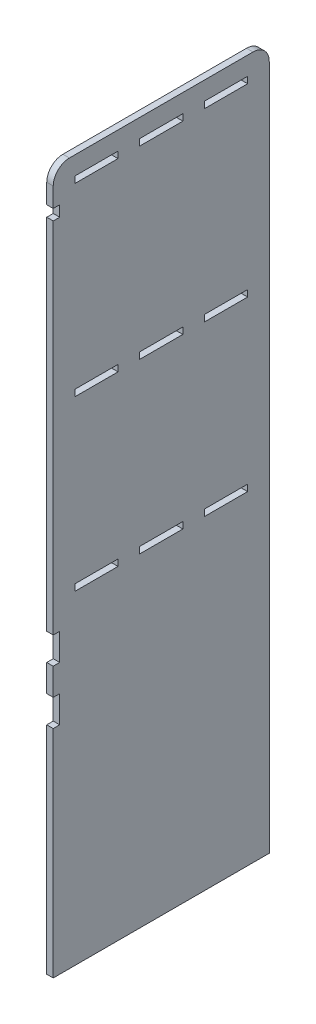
ISO-10303-21;
HEADER;
FILE_DESCRIPTION(('STEP AP214'),'2;1');
FILE_NAME('part.step','',(''),(''),'','','');
FILE_SCHEMA(('AUTOMOTIVE_DESIGN { 1 0 10303 214 1 1 1 1 }'));
ENDSEC;
DATA;
#1=APPLICATION_CONTEXT('core data for automotive mechanical design processes');
#2=APPLICATION_PROTOCOL_DEFINITION('international standard','automotive_design',2000,#1);
#3=PRODUCT_CONTEXT('',#1,'mechanical');
#4=PRODUCT('Part','Part','',(#3));
#5=PRODUCT_RELATED_PRODUCT_CATEGORY('part','',(#4));
#6=PRODUCT_DEFINITION_FORMATION('','',#4);
#7=PRODUCT_DEFINITION_CONTEXT('part definition',#1,'design');
#8=PRODUCT_DEFINITION('design','',#6,#7);
#9=PRODUCT_DEFINITION_SHAPE('','',#8);
#10=(LENGTH_UNIT() NAMED_UNIT(*) SI_UNIT(.MILLI.,.METRE.));
#11=(NAMED_UNIT(*) PLANE_ANGLE_UNIT() SI_UNIT($,.RADIAN.));
#12=(NAMED_UNIT(*) SI_UNIT($,.STERADIAN.) SOLID_ANGLE_UNIT());
#13=UNCERTAINTY_MEASURE_WITH_UNIT(LENGTH_MEASURE(1.E-05),#10,'distance_accuracy_value','');
#14=(GEOMETRIC_REPRESENTATION_CONTEXT(3) GLOBAL_UNCERTAINTY_ASSIGNED_CONTEXT((#13)) GLOBAL_UNIT_ASSIGNED_CONTEXT((#10,
#11,#12)) REPRESENTATION_CONTEXT('',''));
#15=CARTESIAN_POINT('',(0.,0.,0.));
#16=DIRECTION('',(0.,0.,1.));
#17=DIRECTION('',(1.,0.,0.));
#18=AXIS2_PLACEMENT_3D('',#15,#16,#17);
#19=CARTESIAN_POINT('',(12.,620.,170.));
#20=DIRECTION('',(-1.,0.,0.));
#21=DIRECTION('',(0.,0.,1.));
#22=AXIS2_PLACEMENT_3D('',#19,#20,#21);
#23=PLANE('',#22);
#24=DIRECTION('',(0.,-1.,0.));
#25=VECTOR('',#24,1.);
#26=CARTESIAN_POINT('',(12.,604.,40.0000000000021));
#27=LINE('',#26,#25);
#28=CARTESIAN_POINT('',(12.,616.,40.0000000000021));
#29=VERTEX_POINT('',#28);
#30=CARTESIAN_POINT('',(12.,604.,40.0000000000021));
#31=VERTEX_POINT('',#30);
#32=EDGE_CURVE('E435',#29,#31,#27,.T.);
#33=ORIENTED_EDGE('',*,*,#32,.F.);
#34=DIRECTION('',(0.,0.,1.));
#35=VECTOR('',#34,1.);
#36=CARTESIAN_POINT('',(12.,616.,40.0000000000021));
#37=LINE('',#36,#35);
#38=CARTESIAN_POINT('',(12.,616.,-39.9999999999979));
#39=VERTEX_POINT('',#38);
#40=EDGE_CURVE('E446',#39,#29,#37,.T.);
#41=ORIENTED_EDGE('',*,*,#40,.F.);
#42=DIRECTION('',(0.,1.,0.));
#43=VECTOR('',#42,1.);
#44=CARTESIAN_POINT('',(12.,604.,-39.9999999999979));
#45=LINE('',#44,#43);
#46=CARTESIAN_POINT('',(12.,604.,-39.9999999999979));
#47=VERTEX_POINT('',#46);
#48=EDGE_CURVE('E442',#47,#39,#45,.T.);
#49=ORIENTED_EDGE('',*,*,#48,.F.);
#50=DIRECTION('',(0.,0.,-1.));
#51=VECTOR('',#50,1.);
#52=CARTESIAN_POINT('',(12.,604.,40.0000000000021));
#53=LINE('',#52,#51);
#54=EDGE_CURVE('E438',#31,#47,#53,.T.);
#55=ORIENTED_EDGE('',*,*,#54,.F.);
#56=EDGE_LOOP('',(#33,#41,#49,#55));
#57=FACE_BOUND('',#56,.T.);
#58=DIRECTION('',(0.,-1.,0.));
#59=VECTOR('',#58,1.);
#60=CARTESIAN_POINT('',(12.,262.,40.0000000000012));
#61=LINE('',#60,#59);
#62=CARTESIAN_POINT('',(12.,274.,40.0000000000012));
#63=VERTEX_POINT('',#62);
#64=CARTESIAN_POINT('',(12.,262.,40.0000000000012));
#65=VERTEX_POINT('',#64);
#66=EDGE_CURVE('E521',#63,#65,#61,.T.);
#67=ORIENTED_EDGE('',*,*,#66,.F.);
#68=DIRECTION('',(0.,0.,1.));
#69=VECTOR('',#68,1.);
#70=CARTESIAN_POINT('',(12.,274.,40.0000000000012));
#71=LINE('',#70,#69);
#72=CARTESIAN_POINT('',(12.,274.,-39.9999999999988));
#73=VERTEX_POINT('',#72);
#74=EDGE_CURVE('E532',#73,#63,#71,.T.);
#75=ORIENTED_EDGE('',*,*,#74,.F.);
#76=DIRECTION('',(0.,1.,0.));
#77=VECTOR('',#76,1.);
#78=CARTESIAN_POINT('',(12.,262.,-39.9999999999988));
#79=LINE('',#78,#77);
#80=CARTESIAN_POINT('',(12.,262.,-39.9999999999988));
#81=VERTEX_POINT('',#80);
#82=EDGE_CURVE('E528',#81,#73,#79,.T.);
#83=ORIENTED_EDGE('',*,*,#82,.F.);
#84=DIRECTION('',(0.,0.,-1.));
#85=VECTOR('',#84,1.);
#86=CARTESIAN_POINT('',(12.,262.,40.0000000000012));
#87=LINE('',#86,#85);
#88=EDGE_CURVE('E524',#65,#81,#87,.T.);
#89=ORIENTED_EDGE('',*,*,#88,.F.);
#90=EDGE_LOOP('',(#67,#75,#83,#89));
#91=FACE_BOUND('',#90,.T.);
#92=DIRECTION('',(0.,-1.,0.));
#93=VECTOR('',#92,1.);
#94=CARTESIAN_POINT('',(12.,-49.9999999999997,-79.9999999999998));
#95=LINE('',#94,#93);
#96=CARTESIAN_POINT('',(12.,-37.9999999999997,-79.9999999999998));
#97=VERTEX_POINT('',#96);
#98=CARTESIAN_POINT('',(12.,-49.9999999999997,-79.9999999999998));
#99=VERTEX_POINT('',#98);
#100=EDGE_CURVE('E607',#97,#99,#95,.T.);
#101=ORIENTED_EDGE('',*,*,#100,.F.);
#102=DIRECTION('',(0.,0.,1.));
#103=VECTOR('',#102,1.);
#104=CARTESIAN_POINT('',(12.,-37.9999999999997,-79.9999999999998));
#105=LINE('',#104,#103);
#106=CARTESIAN_POINT('',(12.,-37.9999999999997,-160.));
#107=VERTEX_POINT('',#106);
#108=EDGE_CURVE('E618',#107,#97,#105,.T.);
#109=ORIENTED_EDGE('',*,*,#108,.F.);
#110=DIRECTION('',(0.,1.,0.));
#111=VECTOR('',#110,1.);
#112=CARTESIAN_POINT('',(12.,-49.9999999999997,-160.));
#113=LINE('',#112,#111);
#114=CARTESIAN_POINT('',(12.,-49.9999999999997,-160.));
#115=VERTEX_POINT('',#114);
#116=EDGE_CURVE('E614',#115,#107,#113,.T.);
#117=ORIENTED_EDGE('',*,*,#116,.F.);
#118=DIRECTION('',(0.,0.,-1.));
#119=VECTOR('',#118,1.);
#120=CARTESIAN_POINT('',(12.,-49.9999999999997,-79.9999999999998));
#121=LINE('',#120,#119);
#122=EDGE_CURVE('E610',#99,#115,#121,.T.);
#123=ORIENTED_EDGE('',*,*,#122,.F.);
#124=EDGE_LOOP('',(#101,#109,#117,#123));
#125=FACE_BOUND('',#124,.T.);
#126=DIRECTION('',(0.,-1.,0.));
#127=VECTOR('',#126,1.);
#128=CARTESIAN_POINT('',(12.,604.,160.000000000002));
#129=LINE('',#128,#127);
#130=CARTESIAN_POINT('',(12.,616.,160.000000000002));
#131=VERTEX_POINT('',#130);
#132=CARTESIAN_POINT('',(12.,604.,160.000000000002));
#133=VERTEX_POINT('',#132);
#134=EDGE_CURVE('E693',#131,#133,#129,.T.);
#135=ORIENTED_EDGE('',*,*,#134,.F.);
#136=DIRECTION('',(0.,0.,1.));
#137=VECTOR('',#136,1.);
#138=CARTESIAN_POINT('',(12.,616.,160.000000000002));
#139=LINE('',#138,#137);
#140=CARTESIAN_POINT('',(12.,616.,80.0000000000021));
#141=VERTEX_POINT('',#140);
#142=EDGE_CURVE('E704',#141,#131,#139,.T.);
#143=ORIENTED_EDGE('',*,*,#142,.F.);
#144=DIRECTION('',(0.,1.,0.));
#145=VECTOR('',#144,1.);
#146=CARTESIAN_POINT('',(12.,604.,80.0000000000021));
#147=LINE('',#146,#145);
#148=CARTESIAN_POINT('',(12.,604.,80.0000000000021));
#149=VERTEX_POINT('',#148);
#150=EDGE_CURVE('E700',#149,#141,#147,.T.);
#151=ORIENTED_EDGE('',*,*,#150,.F.);
#152=DIRECTION('',(0.,0.,-1.));
#153=VECTOR('',#152,1.);
#154=CARTESIAN_POINT('',(12.,604.,160.000000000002));
#155=LINE('',#154,#153);
#156=EDGE_CURVE('E696',#133,#149,#155,.T.);
#157=ORIENTED_EDGE('',*,*,#156,.F.);
#158=EDGE_LOOP('',(#135,#143,#151,#157));
#159=FACE_BOUND('',#158,.T.);
#160=DIRECTION('',(0.,-1.,0.));
#161=VECTOR('',#160,1.);
#162=CARTESIAN_POINT('',(12.,-650.,200.));
#163=LINE('',#162,#161);
#164=CARTESIAN_POINT('',(12.,-250.,199.999999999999));
#165=VERTEX_POINT('',#164);
#166=CARTESIAN_POINT('',(12.,-650.,200.));
#167=VERTEX_POINT('',#166);
#168=EDGE_CURVE('E779',#165,#167,#163,.T.);
#169=ORIENTED_EDGE('',*,*,#168,.T.);
#170=DIRECTION('',(0.,0.,-1.));
#171=VECTOR('',#170,1.);
#172=CARTESIAN_POINT('',(12.,-650.,200.));
#173=LINE('',#172,#171);
#174=CARTESIAN_POINT('',(12.,-650.,-200.));
#175=VERTEX_POINT('',#174);
#176=EDGE_CURVE('E783',#167,#175,#173,.T.);
#177=ORIENTED_EDGE('',*,*,#176,.T.);
#178=DIRECTION('',(0.,1.,0.));
#179=VECTOR('',#178,1.);
#180=CARTESIAN_POINT('',(12.,-650.,-200.));
#181=LINE('',#180,#179);
#182=CARTESIAN_POINT('',(12.,620.,-200.));
#183=VERTEX_POINT('',#182);
#184=EDGE_CURVE('E787',#175,#183,#181,.T.);
#185=ORIENTED_EDGE('',*,*,#184,.T.);
#186=CARTESIAN_POINT('',(12.,620.,-170.));
#187=DIRECTION('',(1.,0.,0.));
#188=DIRECTION('',(0.,0.,-1.));
#189=AXIS2_PLACEMENT_3D('',#186,#187,#188);
#190=CIRCLE('',#189,30.);
#191=CARTESIAN_POINT('',(12.,650.,-170.));
#192=VERTEX_POINT('',#191);
#193=EDGE_CURVE('E790',#183,#192,#190,.T.);
#194=ORIENTED_EDGE('',*,*,#193,.T.);
#195=DIRECTION('',(0.,0.,1.));
#196=VECTOR('',#195,1.);
#197=CARTESIAN_POINT('',(12.,650.,170.));
#198=LINE('',#197,#196);
#199=CARTESIAN_POINT('',(12.,650.,170.));
#200=VERTEX_POINT('',#199);
#201=EDGE_CURVE('E793',#192,#200,#198,.T.);
#202=ORIENTED_EDGE('',*,*,#201,.T.);
#203=CARTESIAN_POINT('',(12.,620.,170.));
#204=DIRECTION('',(1.,0.,0.));
#205=DIRECTION('',(0.,0.,1.));
#206=AXIS2_PLACEMENT_3D('',#203,#204,#205);
#207=CIRCLE('',#206,30.);
#208=CARTESIAN_POINT('',(12.,620.,200.));
#209=VERTEX_POINT('',#208);
#210=EDGE_CURVE('E796',#200,#209,#207,.T.);
#211=ORIENTED_EDGE('',*,*,#210,.T.);
#212=DIRECTION('',(0.,-1.,0.));
#213=VECTOR('',#212,1.);
#214=CARTESIAN_POINT('',(12.,584.,200.));
#215=LINE('',#214,#213);
#216=CARTESIAN_POINT('',(12.,584.,200.));
#217=VERTEX_POINT('',#216);
#218=EDGE_CURVE('E799',#209,#217,#215,.T.);
#219=ORIENTED_EDGE('',*,*,#218,.T.);
#220=DIRECTION('',(0.,0.,-1.));
#221=VECTOR('',#220,1.);
#222=CARTESIAN_POINT('',(12.,584.,200.));
#223=LINE('',#222,#221);
#224=CARTESIAN_POINT('',(12.,584.,188.));
#225=VERTEX_POINT('',#224);
#226=EDGE_CURVE('E802',#217,#225,#223,.T.);
#227=ORIENTED_EDGE('',*,*,#226,.T.);
#228=DIRECTION('',(0.,-1.,0.));
#229=VECTOR('',#228,1.);
#230=CARTESIAN_POINT('',(12.,564.,188.));
#231=LINE('',#230,#229);
#232=CARTESIAN_POINT('',(12.,564.,188.));
#233=VERTEX_POINT('',#232);
#234=EDGE_CURVE('E805',#225,#233,#231,.T.);
#235=ORIENTED_EDGE('',*,*,#234,.T.);
#236=DIRECTION('',(0.,0.,1.));
#237=VECTOR('',#236,1.);
#238=CARTESIAN_POINT('',(12.,564.,200.));
#239=LINE('',#238,#237);
#240=CARTESIAN_POINT('',(12.,564.,200.));
#241=VERTEX_POINT('',#240);
#242=EDGE_CURVE('E808',#233,#241,#239,.T.);
#243=ORIENTED_EDGE('',*,*,#242,.T.);
#244=DIRECTION('',(0.,-1.,0.));
#245=VECTOR('',#244,1.);
#246=CARTESIAN_POINT('',(12.,-99.9999999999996,200.));
#247=LINE('',#246,#245);
#248=CARTESIAN_POINT('',(12.,-99.9999999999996,200.));
#249=VERTEX_POINT('',#248);
#250=EDGE_CURVE('E811',#241,#249,#247,.T.);
#251=ORIENTED_EDGE('',*,*,#250,.T.);
#252=DIRECTION('',(0.,0.,-1.));
#253=VECTOR('',#252,1.);
#254=CARTESIAN_POINT('',(12.,-99.9999999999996,200.));
#255=LINE('',#254,#253);
#256=CARTESIAN_POINT('',(12.,-99.9999999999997,188.));
#257=VERTEX_POINT('',#256);
#258=EDGE_CURVE('E814',#249,#257,#255,.T.);
#259=ORIENTED_EDGE('',*,*,#258,.T.);
#260=DIRECTION('',(0.,-1.,0.));
#261=VECTOR('',#260,1.);
#262=CARTESIAN_POINT('',(12.,-150.,188.));
#263=LINE('',#262,#261);
#264=CARTESIAN_POINT('',(12.,-150.,188.));
#265=VERTEX_POINT('',#264);
#266=EDGE_CURVE('E817',#257,#265,#263,.T.);
#267=ORIENTED_EDGE('',*,*,#266,.T.);
#268=DIRECTION('',(0.,0.,1.));
#269=VECTOR('',#268,1.);
#270=CARTESIAN_POINT('',(12.,-150.,200.));
#271=LINE('',#270,#269);
#272=CARTESIAN_POINT('',(12.,-150.,200.));
#273=VERTEX_POINT('',#272);
#274=EDGE_CURVE('E820',#265,#273,#271,.T.);
#275=ORIENTED_EDGE('',*,*,#274,.T.);
#276=DIRECTION('',(0.,-1.,0.));
#277=VECTOR('',#276,1.);
#278=CARTESIAN_POINT('',(12.,-200.,199.999999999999));
#279=LINE('',#278,#277);
#280=CARTESIAN_POINT('',(12.,-200.,199.999999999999));
#281=VERTEX_POINT('',#280);
#282=EDGE_CURVE('E823',#273,#281,#279,.T.);
#283=ORIENTED_EDGE('',*,*,#282,.T.);
#284=DIRECTION('',(0.,0.,-1.));
#285=VECTOR('',#284,1.);
#286=CARTESIAN_POINT('',(12.,-200.,199.999999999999));
#287=LINE('',#286,#285);
#288=CARTESIAN_POINT('',(12.,-200.,187.999999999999));
#289=VERTEX_POINT('',#288);
#290=EDGE_CURVE('E826',#281,#289,#287,.T.);
#291=ORIENTED_EDGE('',*,*,#290,.T.);
#292=DIRECTION('',(0.,-1.,0.));
#293=VECTOR('',#292,1.);
#294=CARTESIAN_POINT('',(12.,-250.,187.999999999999));
#295=LINE('',#294,#293);
#296=CARTESIAN_POINT('',(12.,-250.,187.999999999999));
#297=VERTEX_POINT('',#296);
#298=EDGE_CURVE('E829',#289,#297,#295,.T.);
#299=ORIENTED_EDGE('',*,*,#298,.T.);
#300=DIRECTION('',(0.,0.,1.));
#301=VECTOR('',#300,1.);
#302=CARTESIAN_POINT('',(12.,-250.,199.999999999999));
#303=LINE('',#302,#301);
#304=EDGE_CURVE('E832',#297,#165,#303,.T.);
#305=ORIENTED_EDGE('',*,*,#304,.T.);
#306=EDGE_LOOP('',(#169,#177,#185,#194,#202,#211,#219,#227,#235,#243,#251,#259,#267,#275,#283,
#291,#299,#305));
#307=FACE_BOUND('',#306,.T.);
#308=DIRECTION('',(0.,-1.,0.));
#309=VECTOR('',#308,1.);
#310=CARTESIAN_POINT('',(12.,-49.9999999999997,160.));
#311=LINE('',#310,#309);
#312=CARTESIAN_POINT('',(12.,-37.9999999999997,160.));
#313=VERTEX_POINT('',#312);
#314=CARTESIAN_POINT('',(12.,-49.9999999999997,160.));
#315=VERTEX_POINT('',#314);
#316=EDGE_CURVE('E736',#313,#315,#311,.T.);
#317=ORIENTED_EDGE('',*,*,#316,.F.);
#318=DIRECTION('',(0.,0.,1.));
#319=VECTOR('',#318,1.);
#320=CARTESIAN_POINT('',(12.,-37.9999999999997,160.));
#321=LINE('',#320,#319);
#322=CARTESIAN_POINT('',(12.,-37.9999999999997,80.0000000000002));
#323=VERTEX_POINT('',#322);
#324=EDGE_CURVE('E747',#323,#313,#321,.T.);
#325=ORIENTED_EDGE('',*,*,#324,.F.);
#326=DIRECTION('',(0.,1.,0.));
#327=VECTOR('',#326,1.);
#328=CARTESIAN_POINT('',(12.,-49.9999999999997,80.0000000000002));
#329=LINE('',#328,#327);
#330=CARTESIAN_POINT('',(12.,-49.9999999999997,80.0000000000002));
#331=VERTEX_POINT('',#330);
#332=EDGE_CURVE('E743',#331,#323,#329,.T.);
#333=ORIENTED_EDGE('',*,*,#332,.F.);
#334=DIRECTION('',(0.,0.,-1.));
#335=VECTOR('',#334,1.);
#336=CARTESIAN_POINT('',(12.,-49.9999999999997,160.));
#337=LINE('',#336,#335);
#338=EDGE_CURVE('E739',#315,#331,#337,.T.);
#339=ORIENTED_EDGE('',*,*,#338,.F.);
#340=EDGE_LOOP('',(#317,#325,#333,#339));
#341=FACE_BOUND('',#340,.T.);
#342=DIRECTION('',(0.,-1.,0.));
#343=VECTOR('',#342,1.);
#344=CARTESIAN_POINT('',(12.,-49.9999999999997,40.0000000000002));
#345=LINE('',#344,#343);
#346=CARTESIAN_POINT('',(12.,-37.9999999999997,40.0000000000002));
#347=VERTEX_POINT('',#346);
#348=CARTESIAN_POINT('',(12.,-49.9999999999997,40.0000000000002));
#349=VERTEX_POINT('',#348);
#350=EDGE_CURVE('E650',#347,#349,#345,.T.);
#351=ORIENTED_EDGE('',*,*,#350,.F.);
#352=DIRECTION('',(0.,0.,1.));
#353=VECTOR('',#352,1.);
#354=CARTESIAN_POINT('',(12.,-37.9999999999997,40.0000000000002));
#355=LINE('',#354,#353);
#356=CARTESIAN_POINT('',(12.,-37.9999999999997,-39.9999999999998));
#357=VERTEX_POINT('',#356);
#358=EDGE_CURVE('E661',#357,#347,#355,.T.);
#359=ORIENTED_EDGE('',*,*,#358,.F.);
#360=DIRECTION('',(0.,1.,0.));
#361=VECTOR('',#360,1.);
#362=CARTESIAN_POINT('',(12.,-49.9999999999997,-39.9999999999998));
#363=LINE('',#362,#361);
#364=CARTESIAN_POINT('',(12.,-49.9999999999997,-39.9999999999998));
#365=VERTEX_POINT('',#364);
#366=EDGE_CURVE('E657',#365,#357,#363,.T.);
#367=ORIENTED_EDGE('',*,*,#366,.F.);
#368=DIRECTION('',(0.,0.,-1.));
#369=VECTOR('',#368,1.);
#370=CARTESIAN_POINT('',(12.,-49.9999999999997,40.0000000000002));
#371=LINE('',#370,#369);
#372=EDGE_CURVE('E653',#349,#365,#371,.T.);
#373=ORIENTED_EDGE('',*,*,#372,.F.);
#374=EDGE_LOOP('',(#351,#359,#367,#373));
#375=FACE_BOUND('',#374,.T.);
#376=DIRECTION('',(0.,-1.,0.));
#377=VECTOR('',#376,1.);
#378=CARTESIAN_POINT('',(12.,262.,160.000000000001));
#379=LINE('',#378,#377);
#380=CARTESIAN_POINT('',(12.,274.,160.000000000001));
#381=VERTEX_POINT('',#380);
#382=CARTESIAN_POINT('',(12.,262.,160.000000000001));
#383=VERTEX_POINT('',#382);
#384=EDGE_CURVE('E564',#381,#383,#379,.T.);
#385=ORIENTED_EDGE('',*,*,#384,.F.);
#386=DIRECTION('',(0.,0.,1.));
#387=VECTOR('',#386,1.);
#388=CARTESIAN_POINT('',(12.,274.,160.000000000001));
#389=LINE('',#388,#387);
#390=CARTESIAN_POINT('',(12.,274.,80.0000000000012));
#391=VERTEX_POINT('',#390);
#392=EDGE_CURVE('E575',#391,#381,#389,.T.);
#393=ORIENTED_EDGE('',*,*,#392,.F.);
#394=DIRECTION('',(0.,1.,0.));
#395=VECTOR('',#394,1.);
#396=CARTESIAN_POINT('',(12.,262.,80.0000000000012));
#397=LINE('',#396,#395);
#398=CARTESIAN_POINT('',(12.,262.,80.0000000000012));
#399=VERTEX_POINT('',#398);
#400=EDGE_CURVE('E571',#399,#391,#397,.T.);
#401=ORIENTED_EDGE('',*,*,#400,.F.);
#402=DIRECTION('',(0.,0.,-1.));
#403=VECTOR('',#402,1.);
#404=CARTESIAN_POINT('',(12.,262.,160.000000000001));
#405=LINE('',#404,#403);
#406=EDGE_CURVE('E567',#383,#399,#405,.T.);
#407=ORIENTED_EDGE('',*,*,#406,.F.);
#408=EDGE_LOOP('',(#385,#393,#401,#407));
#409=FACE_BOUND('',#408,.T.);
#410=DIRECTION('',(0.,-1.,0.));
#411=VECTOR('',#410,1.);
#412=CARTESIAN_POINT('',(12.,262.,-79.9999999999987));
#413=LINE('',#412,#411);
#414=CARTESIAN_POINT('',(12.,274.,-79.9999999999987));
#415=VERTEX_POINT('',#414);
#416=CARTESIAN_POINT('',(12.,262.,-79.9999999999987));
#417=VERTEX_POINT('',#416);
#418=EDGE_CURVE('E478',#415,#417,#413,.T.);
#419=ORIENTED_EDGE('',*,*,#418,.F.);
#420=DIRECTION('',(0.,0.,1.));
#421=VECTOR('',#420,1.);
#422=CARTESIAN_POINT('',(12.,274.,-79.9999999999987));
#423=LINE('',#422,#421);
#424=CARTESIAN_POINT('',(12.,274.,-159.999999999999));
#425=VERTEX_POINT('',#424);
#426=EDGE_CURVE('E489',#425,#415,#423,.T.);
#427=ORIENTED_EDGE('',*,*,#426,.F.);
#428=DIRECTION('',(0.,1.,0.));
#429=VECTOR('',#428,1.);
#430=CARTESIAN_POINT('',(12.,262.,-159.999999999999));
#431=LINE('',#430,#429);
#432=CARTESIAN_POINT('',(12.,262.,-159.999999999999));
#433=VERTEX_POINT('',#432);
#434=EDGE_CURVE('E485',#433,#425,#431,.T.);
#435=ORIENTED_EDGE('',*,*,#434,.F.);
#436=DIRECTION('',(0.,0.,-1.));
#437=VECTOR('',#436,1.);
#438=CARTESIAN_POINT('',(12.,262.,-79.9999999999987));
#439=LINE('',#438,#437);
#440=EDGE_CURVE('E481',#417,#433,#439,.T.);
#441=ORIENTED_EDGE('',*,*,#440,.F.);
#442=EDGE_LOOP('',(#419,#427,#435,#441));
#443=FACE_BOUND('',#442,.T.);
#444=DIRECTION('',(0.,-1.,0.));
#445=VECTOR('',#444,1.);
#446=CARTESIAN_POINT('',(12.,604.,-79.9999999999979));
#447=LINE('',#446,#445);
#448=CARTESIAN_POINT('',(12.,616.,-79.9999999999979));
#449=VERTEX_POINT('',#448);
#450=CARTESIAN_POINT('',(12.,604.,-79.9999999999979));
#451=VERTEX_POINT('',#450);
#452=EDGE_CURVE('E387',#449,#451,#447,.T.);
#453=ORIENTED_EDGE('',*,*,#452,.F.);
#454=DIRECTION('',(0.,0.,1.));
#455=VECTOR('',#454,1.);
#456=CARTESIAN_POINT('',(12.,616.,-79.9999999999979));
#457=LINE('',#456,#455);
#458=CARTESIAN_POINT('',(12.,616.,-159.999999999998));
#459=VERTEX_POINT('',#458);
#460=EDGE_CURVE('E413',#459,#449,#457,.T.);
#461=ORIENTED_EDGE('',*,*,#460,.F.);
#462=DIRECTION('',(0.,1.,0.));
#463=VECTOR('',#462,1.);
#464=CARTESIAN_POINT('',(12.,604.,-159.999999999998));
#465=LINE('',#464,#463);
#466=CARTESIAN_POINT('',(12.,604.,-159.999999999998));
#467=VERTEX_POINT('',#466);
#468=EDGE_CURVE('E409',#467,#459,#465,.T.);
#469=ORIENTED_EDGE('',*,*,#468,.F.);
#470=DIRECTION('',(0.,0.,-1.));
#471=VECTOR('',#470,1.);
#472=CARTESIAN_POINT('',(12.,604.,-79.9999999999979));
#473=LINE('',#472,#471);
#474=EDGE_CURVE('E396',#451,#467,#473,.T.);
#475=ORIENTED_EDGE('',*,*,#474,.F.);
#476=EDGE_LOOP('',(#453,#461,#469,#475));
#477=FACE_BOUND('',#476,.T.);
#478=ADVANCED_FACE('F45',(#57,#91,#125,#159,#307,#341,#375,#409,#443,#477),#23,.F.);
#479=CARTESIAN_POINT('',(0.,620.,170.));
#480=DIRECTION('',(-1.,0.,0.));
#481=DIRECTION('',(0.,0.,1.));
#482=AXIS2_PLACEMENT_3D('',#479,#480,#481);
#483=PLANE('',#482);
#484=DIRECTION('',(0.,-1.,0.));
#485=VECTOR('',#484,1.);
#486=CARTESIAN_POINT('',(0.,-650.,200.));
#487=LINE('',#486,#485);
#488=CARTESIAN_POINT('',(0.,-250.,199.999999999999));
#489=VERTEX_POINT('',#488);
#490=CARTESIAN_POINT('',(0.,-650.,200.));
#491=VERTEX_POINT('',#490);
#492=EDGE_CURVE('E778',#489,#491,#487,.T.);
#493=ORIENTED_EDGE('',*,*,#492,.F.);
#494=DIRECTION('',(0.,0.,1.));
#495=VECTOR('',#494,1.);
#496=CARTESIAN_POINT('',(0.,-250.,199.999999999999));
#497=LINE('',#496,#495);
#498=CARTESIAN_POINT('',(0.,-250.,187.999999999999));
#499=VERTEX_POINT('',#498);
#500=EDGE_CURVE('E784',#499,#489,#497,.T.);
#501=ORIENTED_EDGE('',*,*,#500,.F.);
#502=DIRECTION('',(0.,-1.,0.));
#503=VECTOR('',#502,1.);
#504=CARTESIAN_POINT('',(0.,-250.,187.999999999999));
#505=LINE('',#504,#503);
#506=CARTESIAN_POINT('',(0.,-200.,187.999999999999));
#507=VERTEX_POINT('',#506);
#508=EDGE_CURVE('E884',#507,#499,#505,.T.);
#509=ORIENTED_EDGE('',*,*,#508,.F.);
#510=DIRECTION('',(0.,0.,-1.));
#511=VECTOR('',#510,1.);
#512=CARTESIAN_POINT('',(0.,-200.,199.999999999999));
#513=LINE('',#512,#511);
#514=CARTESIAN_POINT('',(0.,-200.,199.999999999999));
#515=VERTEX_POINT('',#514);
#516=EDGE_CURVE('E881',#515,#507,#513,.T.);
#517=ORIENTED_EDGE('',*,*,#516,.F.);
#518=DIRECTION('',(0.,-1.,0.));
#519=VECTOR('',#518,1.);
#520=CARTESIAN_POINT('',(0.,-200.,199.999999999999));
#521=LINE('',#520,#519);
#522=CARTESIAN_POINT('',(0.,-150.,200.));
#523=VERTEX_POINT('',#522);
#524=EDGE_CURVE('E878',#523,#515,#521,.T.);
#525=ORIENTED_EDGE('',*,*,#524,.F.);
#526=DIRECTION('',(0.,0.,1.));
#527=VECTOR('',#526,1.);
#528=CARTESIAN_POINT('',(0.,-150.,200.));
#529=LINE('',#528,#527);
#530=CARTESIAN_POINT('',(0.,-150.,188.));
#531=VERTEX_POINT('',#530);
#532=EDGE_CURVE('E875',#531,#523,#529,.T.);
#533=ORIENTED_EDGE('',*,*,#532,.F.);
#534=DIRECTION('',(0.,-1.,0.));
#535=VECTOR('',#534,1.);
#536=CARTESIAN_POINT('',(0.,-150.,188.));
#537=LINE('',#536,#535);
#538=CARTESIAN_POINT('',(0.,-99.9999999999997,188.));
#539=VERTEX_POINT('',#538);
#540=EDGE_CURVE('E872',#539,#531,#537,.T.);
#541=ORIENTED_EDGE('',*,*,#540,.F.);
#542=DIRECTION('',(0.,0.,-1.));
#543=VECTOR('',#542,1.);
#544=CARTESIAN_POINT('',(0.,-99.9999999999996,200.));
#545=LINE('',#544,#543);
#546=CARTESIAN_POINT('',(0.,-99.9999999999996,200.));
#547=VERTEX_POINT('',#546);
#548=EDGE_CURVE('E869',#547,#539,#545,.T.);
#549=ORIENTED_EDGE('',*,*,#548,.F.);
#550=DIRECTION('',(0.,-1.,0.));
#551=VECTOR('',#550,1.);
#552=CARTESIAN_POINT('',(0.,-99.9999999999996,200.));
#553=LINE('',#552,#551);
#554=CARTESIAN_POINT('',(0.,564.,200.));
#555=VERTEX_POINT('',#554);
#556=EDGE_CURVE('E866',#555,#547,#553,.T.);
#557=ORIENTED_EDGE('',*,*,#556,.F.);
#558=DIRECTION('',(0.,0.,1.));
#559=VECTOR('',#558,1.);
#560=CARTESIAN_POINT('',(0.,564.,200.));
#561=LINE('',#560,#559);
#562=CARTESIAN_POINT('',(0.,564.,188.));
#563=VERTEX_POINT('',#562);
#564=EDGE_CURVE('E863',#563,#555,#561,.T.);
#565=ORIENTED_EDGE('',*,*,#564,.F.);
#566=DIRECTION('',(0.,-1.,0.));
#567=VECTOR('',#566,1.);
#568=CARTESIAN_POINT('',(0.,564.,188.));
#569=LINE('',#568,#567);
#570=CARTESIAN_POINT('',(0.,584.,188.));
#571=VERTEX_POINT('',#570);
#572=EDGE_CURVE('E860',#571,#563,#569,.T.);
#573=ORIENTED_EDGE('',*,*,#572,.F.);
#574=DIRECTION('',(0.,0.,-1.));
#575=VECTOR('',#574,1.);
#576=CARTESIAN_POINT('',(0.,584.,200.));
#577=LINE('',#576,#575);
#578=CARTESIAN_POINT('',(0.,584.,200.));
#579=VERTEX_POINT('',#578);
#580=EDGE_CURVE('E857',#579,#571,#577,.T.);
#581=ORIENTED_EDGE('',*,*,#580,.F.);
#582=DIRECTION('',(0.,-1.,0.));
#583=VECTOR('',#582,1.);
#584=CARTESIAN_POINT('',(0.,584.,200.));
#585=LINE('',#584,#583);
#586=CARTESIAN_POINT('',(0.,620.,200.));
#587=VERTEX_POINT('',#586);
#588=EDGE_CURVE('E854',#587,#579,#585,.T.);
#589=ORIENTED_EDGE('',*,*,#588,.F.);
#590=CARTESIAN_POINT('',(0.,620.,170.));
#591=DIRECTION('',(1.,0.,0.));
#592=DIRECTION('',(0.,0.,1.));
#593=AXIS2_PLACEMENT_3D('',#590,#591,#592);
#594=CIRCLE('',#593,30.);
#595=CARTESIAN_POINT('',(0.,650.,170.));
#596=VERTEX_POINT('',#595);
#597=EDGE_CURVE('E851',#596,#587,#594,.T.);
#598=ORIENTED_EDGE('',*,*,#597,.F.);
#599=DIRECTION('',(0.,0.,1.));
#600=VECTOR('',#599,1.);
#601=CARTESIAN_POINT('',(0.,650.,170.));
#602=LINE('',#601,#600);
#603=CARTESIAN_POINT('',(0.,650.,-170.));
#604=VERTEX_POINT('',#603);
#605=EDGE_CURVE('E848',#604,#596,#602,.T.);
#606=ORIENTED_EDGE('',*,*,#605,.F.);
#607=CARTESIAN_POINT('',(0.,620.,-170.));
#608=DIRECTION('',(1.,0.,0.));
#609=DIRECTION('',(0.,0.,-1.));
#610=AXIS2_PLACEMENT_3D('',#607,#608,#609);
#611=CIRCLE('',#610,30.);
#612=CARTESIAN_POINT('',(0.,620.,-200.));
#613=VERTEX_POINT('',#612);
#614=EDGE_CURVE('E845',#613,#604,#611,.T.);
#615=ORIENTED_EDGE('',*,*,#614,.F.);
#616=DIRECTION('',(0.,1.,0.));
#617=VECTOR('',#616,1.);
#618=CARTESIAN_POINT('',(0.,-650.,-200.));
#619=LINE('',#618,#617);
#620=CARTESIAN_POINT('',(0.,-650.,-200.));
#621=VERTEX_POINT('',#620);
#622=EDGE_CURVE('E842',#621,#613,#619,.T.);
#623=ORIENTED_EDGE('',*,*,#622,.F.);
#624=DIRECTION('',(0.,0.,-1.));
#625=VECTOR('',#624,1.);
#626=CARTESIAN_POINT('',(0.,-650.,200.));
#627=LINE('',#626,#625);
#628=EDGE_CURVE('E839',#491,#621,#627,.T.);
#629=ORIENTED_EDGE('',*,*,#628,.F.);
#630=EDGE_LOOP('',(#493,#501,#509,#517,#525,#533,#541,#549,#557,#565,#573,#581,#589,#598,#606,
#615,#623,#629));
#631=FACE_BOUND('',#630,.T.);
#632=DIRECTION('',(0.,0.,1.));
#633=VECTOR('',#632,1.);
#634=CARTESIAN_POINT('',(0.,-37.9999999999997,160.));
#635=LINE('',#634,#633);
#636=CARTESIAN_POINT('',(0.,-37.9999999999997,80.0000000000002));
#637=VERTEX_POINT('',#636);
#638=CARTESIAN_POINT('',(0.,-37.9999999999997,160.));
#639=VERTEX_POINT('',#638);
#640=EDGE_CURVE('E740',#637,#639,#635,.T.);
#641=ORIENTED_EDGE('',*,*,#640,.T.);
#642=DIRECTION('',(0.,-1.,0.));
#643=VECTOR('',#642,1.);
#644=CARTESIAN_POINT('',(0.,-49.9999999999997,160.));
#645=LINE('',#644,#643);
#646=CARTESIAN_POINT('',(0.,-49.9999999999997,160.));
#647=VERTEX_POINT('',#646);
#648=EDGE_CURVE('E735',#639,#647,#645,.T.);
#649=ORIENTED_EDGE('',*,*,#648,.T.);
#650=DIRECTION('',(0.,0.,-1.));
#651=VECTOR('',#650,1.);
#652=CARTESIAN_POINT('',(0.,-49.9999999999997,160.));
#653=LINE('',#652,#651);
#654=CARTESIAN_POINT('',(0.,-49.9999999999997,80.0000000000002));
#655=VERTEX_POINT('',#654);
#656=EDGE_CURVE('E754',#647,#655,#653,.T.);
#657=ORIENTED_EDGE('',*,*,#656,.T.);
#658=DIRECTION('',(0.,1.,0.));
#659=VECTOR('',#658,1.);
#660=CARTESIAN_POINT('',(0.,-49.9999999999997,80.0000000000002));
#661=LINE('',#660,#659);
#662=EDGE_CURVE('E758',#655,#637,#661,.T.);
#663=ORIENTED_EDGE('',*,*,#662,.T.);
#664=EDGE_LOOP('',(#641,#649,#657,#663));
#665=FACE_BOUND('',#664,.T.);
#666=DIRECTION('',(0.,0.,1.));
#667=VECTOR('',#666,1.);
#668=CARTESIAN_POINT('',(0.,616.,160.000000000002));
#669=LINE('',#668,#667);
#670=CARTESIAN_POINT('',(0.,616.,80.0000000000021));
#671=VERTEX_POINT('',#670);
#672=CARTESIAN_POINT('',(0.,616.,160.000000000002));
#673=VERTEX_POINT('',#672);
#674=EDGE_CURVE('E697',#671,#673,#669,.T.);
#675=ORIENTED_EDGE('',*,*,#674,.T.);
#676=DIRECTION('',(0.,-1.,0.));
#677=VECTOR('',#676,1.);
#678=CARTESIAN_POINT('',(0.,604.,160.000000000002));
#679=LINE('',#678,#677);
#680=CARTESIAN_POINT('',(0.,604.,160.000000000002));
#681=VERTEX_POINT('',#680);
#682=EDGE_CURVE('E692',#673,#681,#679,.T.);
#683=ORIENTED_EDGE('',*,*,#682,.T.);
#684=DIRECTION('',(0.,0.,-1.));
#685=VECTOR('',#684,1.);
#686=CARTESIAN_POINT('',(0.,604.,160.000000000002));
#687=LINE('',#686,#685);
#688=CARTESIAN_POINT('',(0.,604.,80.0000000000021));
#689=VERTEX_POINT('',#688);
#690=EDGE_CURVE('E711',#681,#689,#687,.T.);
#691=ORIENTED_EDGE('',*,*,#690,.T.);
#692=DIRECTION('',(0.,1.,0.));
#693=VECTOR('',#692,1.);
#694=CARTESIAN_POINT('',(0.,604.,80.0000000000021));
#695=LINE('',#694,#693);
#696=EDGE_CURVE('E715',#689,#671,#695,.T.);
#697=ORIENTED_EDGE('',*,*,#696,.T.);
#698=EDGE_LOOP('',(#675,#683,#691,#697));
#699=FACE_BOUND('',#698,.T.);
#700=DIRECTION('',(0.,0.,1.));
#701=VECTOR('',#700,1.);
#702=CARTESIAN_POINT('',(0.,-37.9999999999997,40.0000000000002));
#703=LINE('',#702,#701);
#704=CARTESIAN_POINT('',(0.,-37.9999999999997,-39.9999999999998));
#705=VERTEX_POINT('',#704);
#706=CARTESIAN_POINT('',(0.,-37.9999999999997,40.0000000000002));
#707=VERTEX_POINT('',#706);
#708=EDGE_CURVE('E654',#705,#707,#703,.T.);
#709=ORIENTED_EDGE('',*,*,#708,.T.);
#710=DIRECTION('',(0.,-1.,0.));
#711=VECTOR('',#710,1.);
#712=CARTESIAN_POINT('',(0.,-49.9999999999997,40.0000000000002));
#713=LINE('',#712,#711);
#714=CARTESIAN_POINT('',(0.,-49.9999999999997,40.0000000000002));
#715=VERTEX_POINT('',#714);
#716=EDGE_CURVE('E649',#707,#715,#713,.T.);
#717=ORIENTED_EDGE('',*,*,#716,.T.);
#718=DIRECTION('',(0.,0.,-1.));
#719=VECTOR('',#718,1.);
#720=CARTESIAN_POINT('',(0.,-49.9999999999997,40.0000000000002));
#721=LINE('',#720,#719);
#722=CARTESIAN_POINT('',(0.,-49.9999999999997,-39.9999999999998));
#723=VERTEX_POINT('',#722);
#724=EDGE_CURVE('E668',#715,#723,#721,.T.);
#725=ORIENTED_EDGE('',*,*,#724,.T.);
#726=DIRECTION('',(0.,1.,0.));
#727=VECTOR('',#726,1.);
#728=CARTESIAN_POINT('',(0.,-49.9999999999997,-39.9999999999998));
#729=LINE('',#728,#727);
#730=EDGE_CURVE('E672',#723,#705,#729,.T.);
#731=ORIENTED_EDGE('',*,*,#730,.T.);
#732=EDGE_LOOP('',(#709,#717,#725,#731));
#733=FACE_BOUND('',#732,.T.);
#734=DIRECTION('',(0.,0.,1.));
#735=VECTOR('',#734,1.);
#736=CARTESIAN_POINT('',(0.,-37.9999999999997,-79.9999999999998));
#737=LINE('',#736,#735);
#738=CARTESIAN_POINT('',(0.,-37.9999999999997,-160.));
#739=VERTEX_POINT('',#738);
#740=CARTESIAN_POINT('',(0.,-37.9999999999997,-79.9999999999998));
#741=VERTEX_POINT('',#740);
#742=EDGE_CURVE('E611',#739,#741,#737,.T.);
#743=ORIENTED_EDGE('',*,*,#742,.T.);
#744=DIRECTION('',(0.,-1.,0.));
#745=VECTOR('',#744,1.);
#746=CARTESIAN_POINT('',(0.,-49.9999999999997,-79.9999999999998));
#747=LINE('',#746,#745);
#748=CARTESIAN_POINT('',(0.,-49.9999999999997,-79.9999999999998));
#749=VERTEX_POINT('',#748);
#750=EDGE_CURVE('E606',#741,#749,#747,.T.);
#751=ORIENTED_EDGE('',*,*,#750,.T.);
#752=DIRECTION('',(0.,0.,-1.));
#753=VECTOR('',#752,1.);
#754=CARTESIAN_POINT('',(0.,-49.9999999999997,-79.9999999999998));
#755=LINE('',#754,#753);
#756=CARTESIAN_POINT('',(0.,-49.9999999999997,-160.));
#757=VERTEX_POINT('',#756);
#758=EDGE_CURVE('E625',#749,#757,#755,.T.);
#759=ORIENTED_EDGE('',*,*,#758,.T.);
#760=DIRECTION('',(0.,1.,0.));
#761=VECTOR('',#760,1.);
#762=CARTESIAN_POINT('',(0.,-49.9999999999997,-160.));
#763=LINE('',#762,#761);
#764=EDGE_CURVE('E629',#757,#739,#763,.T.);
#765=ORIENTED_EDGE('',*,*,#764,.T.);
#766=EDGE_LOOP('',(#743,#751,#759,#765));
#767=FACE_BOUND('',#766,.T.);
#768=DIRECTION('',(0.,0.,1.));
#769=VECTOR('',#768,1.);
#770=CARTESIAN_POINT('',(0.,274.,160.000000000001));
#771=LINE('',#770,#769);
#772=CARTESIAN_POINT('',(0.,274.,80.0000000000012));
#773=VERTEX_POINT('',#772);
#774=CARTESIAN_POINT('',(0.,274.,160.000000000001));
#775=VERTEX_POINT('',#774);
#776=EDGE_CURVE('E568',#773,#775,#771,.T.);
#777=ORIENTED_EDGE('',*,*,#776,.T.);
#778=DIRECTION('',(0.,-1.,0.));
#779=VECTOR('',#778,1.);
#780=CARTESIAN_POINT('',(0.,262.,160.000000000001));
#781=LINE('',#780,#779);
#782=CARTESIAN_POINT('',(0.,262.,160.000000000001));
#783=VERTEX_POINT('',#782);
#784=EDGE_CURVE('E563',#775,#783,#781,.T.);
#785=ORIENTED_EDGE('',*,*,#784,.T.);
#786=DIRECTION('',(0.,0.,-1.));
#787=VECTOR('',#786,1.);
#788=CARTESIAN_POINT('',(0.,262.,160.000000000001));
#789=LINE('',#788,#787);
#790=CARTESIAN_POINT('',(0.,262.,80.0000000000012));
#791=VERTEX_POINT('',#790);
#792=EDGE_CURVE('E582',#783,#791,#789,.T.);
#793=ORIENTED_EDGE('',*,*,#792,.T.);
#794=DIRECTION('',(0.,1.,0.));
#795=VECTOR('',#794,1.);
#796=CARTESIAN_POINT('',(0.,262.,80.0000000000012));
#797=LINE('',#796,#795);
#798=EDGE_CURVE('E586',#791,#773,#797,.T.);
#799=ORIENTED_EDGE('',*,*,#798,.T.);
#800=EDGE_LOOP('',(#777,#785,#793,#799));
#801=FACE_BOUND('',#800,.T.);
#802=DIRECTION('',(0.,0.,1.));
#803=VECTOR('',#802,1.);
#804=CARTESIAN_POINT('',(0.,274.,40.0000000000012));
#805=LINE('',#804,#803);
#806=CARTESIAN_POINT('',(0.,274.,-39.9999999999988));
#807=VERTEX_POINT('',#806);
#808=CARTESIAN_POINT('',(0.,274.,40.0000000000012));
#809=VERTEX_POINT('',#808);
#810=EDGE_CURVE('E525',#807,#809,#805,.T.);
#811=ORIENTED_EDGE('',*,*,#810,.T.);
#812=DIRECTION('',(0.,-1.,0.));
#813=VECTOR('',#812,1.);
#814=CARTESIAN_POINT('',(0.,262.,40.0000000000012));
#815=LINE('',#814,#813);
#816=CARTESIAN_POINT('',(0.,262.,40.0000000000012));
#817=VERTEX_POINT('',#816);
#818=EDGE_CURVE('E520',#809,#817,#815,.T.);
#819=ORIENTED_EDGE('',*,*,#818,.T.);
#820=DIRECTION('',(0.,0.,-1.));
#821=VECTOR('',#820,1.);
#822=CARTESIAN_POINT('',(0.,262.,40.0000000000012));
#823=LINE('',#822,#821);
#824=CARTESIAN_POINT('',(0.,262.,-39.9999999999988));
#825=VERTEX_POINT('',#824);
#826=EDGE_CURVE('E539',#817,#825,#823,.T.);
#827=ORIENTED_EDGE('',*,*,#826,.T.);
#828=DIRECTION('',(0.,1.,0.));
#829=VECTOR('',#828,1.);
#830=CARTESIAN_POINT('',(0.,262.,-39.9999999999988));
#831=LINE('',#830,#829);
#832=EDGE_CURVE('E543',#825,#807,#831,.T.);
#833=ORIENTED_EDGE('',*,*,#832,.T.);
#834=EDGE_LOOP('',(#811,#819,#827,#833));
#835=FACE_BOUND('',#834,.T.);
#836=DIRECTION('',(0.,0.,1.));
#837=VECTOR('',#836,1.);
#838=CARTESIAN_POINT('',(0.,274.,-79.9999999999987));
#839=LINE('',#838,#837);
#840=CARTESIAN_POINT('',(0.,274.,-159.999999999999));
#841=VERTEX_POINT('',#840);
#842=CARTESIAN_POINT('',(0.,274.,-79.9999999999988));
#843=VERTEX_POINT('',#842);
#844=EDGE_CURVE('E482',#841,#843,#839,.T.);
#845=ORIENTED_EDGE('',*,*,#844,.T.);
#846=DIRECTION('',(0.,-1.,0.));
#847=VECTOR('',#846,1.);
#848=CARTESIAN_POINT('',(0.,262.,-79.9999999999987));
#849=LINE('',#848,#847);
#850=CARTESIAN_POINT('',(0.,262.,-79.9999999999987));
#851=VERTEX_POINT('',#850);
#852=EDGE_CURVE('E477',#843,#851,#849,.T.);
#853=ORIENTED_EDGE('',*,*,#852,.T.);
#854=DIRECTION('',(0.,0.,-1.));
#855=VECTOR('',#854,1.);
#856=CARTESIAN_POINT('',(0.,262.,-79.9999999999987));
#857=LINE('',#856,#855);
#858=CARTESIAN_POINT('',(0.,262.,-159.999999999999));
#859=VERTEX_POINT('',#858);
#860=EDGE_CURVE('E496',#851,#859,#857,.T.);
#861=ORIENTED_EDGE('',*,*,#860,.T.);
#862=DIRECTION('',(0.,1.,0.));
#863=VECTOR('',#862,1.);
#864=CARTESIAN_POINT('',(0.,262.,-159.999999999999));
#865=LINE('',#864,#863);
#866=EDGE_CURVE('E500',#859,#841,#865,.T.);
#867=ORIENTED_EDGE('',*,*,#866,.T.);
#868=EDGE_LOOP('',(#845,#853,#861,#867));
#869=FACE_BOUND('',#868,.T.);
#870=DIRECTION('',(0.,0.,1.));
#871=VECTOR('',#870,1.);
#872=CARTESIAN_POINT('',(0.,616.,40.0000000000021));
#873=LINE('',#872,#871);
#874=CARTESIAN_POINT('',(0.,616.,-39.9999999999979));
#875=VERTEX_POINT('',#874);
#876=CARTESIAN_POINT('',(0.,616.,40.0000000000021));
#877=VERTEX_POINT('',#876);
#878=EDGE_CURVE('E439',#875,#877,#873,.T.);
#879=ORIENTED_EDGE('',*,*,#878,.T.);
#880=DIRECTION('',(0.,-1.,0.));
#881=VECTOR('',#880,1.);
#882=CARTESIAN_POINT('',(0.,604.,40.0000000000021));
#883=LINE('',#882,#881);
#884=CARTESIAN_POINT('',(0.,604.,40.0000000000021));
#885=VERTEX_POINT('',#884);
#886=EDGE_CURVE('E405',#877,#885,#883,.T.);
#887=ORIENTED_EDGE('',*,*,#886,.T.);
#888=DIRECTION('',(0.,0.,-1.));
#889=VECTOR('',#888,1.);
#890=CARTESIAN_POINT('',(0.,604.,40.0000000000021));
#891=LINE('',#890,#889);
#892=CARTESIAN_POINT('',(0.,604.,-39.9999999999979));
#893=VERTEX_POINT('',#892);
#894=EDGE_CURVE('E453',#885,#893,#891,.T.);
#895=ORIENTED_EDGE('',*,*,#894,.T.);
#896=DIRECTION('',(0.,1.,0.));
#897=VECTOR('',#896,1.);
#898=CARTESIAN_POINT('',(0.,604.,-39.9999999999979));
#899=LINE('',#898,#897);
#900=EDGE_CURVE('E457',#893,#875,#899,.T.);
#901=ORIENTED_EDGE('',*,*,#900,.T.);
#902=EDGE_LOOP('',(#879,#887,#895,#901));
#903=FACE_BOUND('',#902,.T.);
#904=DIRECTION('',(0.,0.,1.));
#905=VECTOR('',#904,1.);
#906=CARTESIAN_POINT('',(0.,616.,-79.9999999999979));
#907=LINE('',#906,#905);
#908=CARTESIAN_POINT('',(0.,616.,-159.999999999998));
#909=VERTEX_POINT('',#908);
#910=CARTESIAN_POINT('',(0.,616.,-79.9999999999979));
#911=VERTEX_POINT('',#910);
#912=EDGE_CURVE('E397',#909,#911,#907,.T.);
#913=ORIENTED_EDGE('',*,*,#912,.T.);
#914=DIRECTION('',(0.,-1.,0.));
#915=VECTOR('',#914,1.);
#916=CARTESIAN_POINT('',(0.,604.,-79.9999999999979));
#917=LINE('',#916,#915);
#918=CARTESIAN_POINT('',(0.,604.,-79.9999999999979));
#919=VERTEX_POINT('',#918);
#920=EDGE_CURVE('E69',#911,#919,#917,.T.);
#921=ORIENTED_EDGE('',*,*,#920,.T.);
#922=DIRECTION('',(0.,0.,-1.));
#923=VECTOR('',#922,1.);
#924=CARTESIAN_POINT('',(0.,604.,-79.9999999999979));
#925=LINE('',#924,#923);
#926=CARTESIAN_POINT('',(0.,604.,-159.999999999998));
#927=VERTEX_POINT('',#926);
#928=EDGE_CURVE('E403',#919,#927,#925,.T.);
#929=ORIENTED_EDGE('',*,*,#928,.T.);
#930=DIRECTION('',(0.,1.,0.));
#931=VECTOR('',#930,1.);
#932=CARTESIAN_POINT('',(0.,604.,-159.999999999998));
#933=LINE('',#932,#931);
#934=EDGE_CURVE('E422',#927,#909,#933,.T.);
#935=ORIENTED_EDGE('',*,*,#934,.T.);
#936=EDGE_LOOP('',(#913,#921,#929,#935));
#937=FACE_BOUND('',#936,.T.);
#938=ADVANCED_FACE('F963',(#631,#665,#699,#733,#767,#801,#835,#869,#903,#937),#483,.T.);
#939=CARTESIAN_POINT('',(12.,-650.,200.));
#940=DIRECTION('',(0.,0.,-1.));
#941=DIRECTION('',(0.,1.,0.));
#942=AXIS2_PLACEMENT_3D('',#939,#940,#941);
#943=PLANE('',#942);
#944=ORIENTED_EDGE('',*,*,#492,.T.);
#945=DIRECTION('',(-1.,0.,0.));
#946=VECTOR('',#945,1.);
#947=CARTESIAN_POINT('',(12.,-650.,200.));
#948=LINE('',#947,#946);
#949=EDGE_CURVE('E11',#167,#491,#948,.T.);
#950=ORIENTED_EDGE('',*,*,#949,.F.);
#951=ORIENTED_EDGE('',*,*,#168,.F.);
#952=DIRECTION('',(-1.,0.,0.));
#953=VECTOR('',#952,1.);
#954=CARTESIAN_POINT('',(12.,-250.,199.999999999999));
#955=LINE('',#954,#953);
#956=EDGE_CURVE('E835',#165,#489,#955,.T.);
#957=ORIENTED_EDGE('',*,*,#956,.T.);
#958=EDGE_LOOP('',(#944,#950,#951,#957));
#959=FACE_BOUND('',#958,.T.);
#960=ADVANCED_FACE('F47',(#959),#943,.F.);
#961=CARTESIAN_POINT('',(12.,-650.,200.));
#962=DIRECTION('',(0.,1.,0.));
#963=DIRECTION('',(0.,0.,1.));
#964=AXIS2_PLACEMENT_3D('',#961,#962,#963);
#965=PLANE('',#964);
#966=ORIENTED_EDGE('',*,*,#628,.T.);
#967=DIRECTION('',(-1.,0.,0.));
#968=VECTOR('',#967,1.);
#969=CARTESIAN_POINT('',(12.,-650.,-200.));
#970=LINE('',#969,#968);
#971=EDGE_CURVE('E54',#175,#621,#970,.T.);
#972=ORIENTED_EDGE('',*,*,#971,.F.);
#973=ORIENTED_EDGE('',*,*,#176,.F.);
#974=ORIENTED_EDGE('',*,*,#949,.T.);
#975=EDGE_LOOP('',(#966,#972,#973,#974));
#976=FACE_BOUND('',#975,.T.);
#977=ADVANCED_FACE('F981',(#976),#965,.F.);
#978=CARTESIAN_POINT('',(12.,-650.,-200.));
#979=DIRECTION('',(0.,0.,1.));
#980=DIRECTION('',(0.,-1.,0.));
#981=AXIS2_PLACEMENT_3D('',#978,#979,#980);
#982=PLANE('',#981);
#983=ORIENTED_EDGE('',*,*,#622,.T.);
#984=DIRECTION('',(-1.,0.,0.));
#985=VECTOR('',#984,1.);
#986=CARTESIAN_POINT('',(12.,620.,-200.));
#987=LINE('',#986,#985);
#988=EDGE_CURVE('E948',#183,#613,#987,.T.);
#989=ORIENTED_EDGE('',*,*,#988,.F.);
#990=ORIENTED_EDGE('',*,*,#184,.F.);
#991=ORIENTED_EDGE('',*,*,#971,.T.);
#992=EDGE_LOOP('',(#983,#989,#990,#991));
#993=FACE_BOUND('',#992,.T.);
#994=ADVANCED_FACE('F957',(#993),#982,.F.);
#995=CARTESIAN_POINT('',(12.,620.,-170.));
#996=DIRECTION('',(-1.,0.,0.));
#997=DIRECTION('',(0.,0.,1.));
#998=AXIS2_PLACEMENT_3D('',#995,#996,#997);
#999=CYLINDRICAL_SURFACE('',#998,30.);
#1000=ORIENTED_EDGE('',*,*,#614,.T.);
#1001=DIRECTION('',(-1.,0.,0.));
#1002=VECTOR('',#1001,1.);
#1003=CARTESIAN_POINT('',(12.,650.,-170.));
#1004=LINE('',#1003,#1002);
#1005=EDGE_CURVE('E944',#192,#604,#1004,.T.);
#1006=ORIENTED_EDGE('',*,*,#1005,.F.);
#1007=ORIENTED_EDGE('',*,*,#193,.F.);
#1008=ORIENTED_EDGE('',*,*,#988,.T.);
#1009=EDGE_LOOP('',(#1000,#1006,#1007,#1008));
#1010=FACE_BOUND('',#1009,.T.);
#1011=ADVANCED_FACE('F969',(#1010),#999,.T.);
#1012=CARTESIAN_POINT('',(12.,650.,170.));
#1013=DIRECTION('',(0.,-1.,0.));
#1014=DIRECTION('',(0.,0.,-1.));
#1015=AXIS2_PLACEMENT_3D('',#1012,#1013,#1014);
#1016=PLANE('',#1015);
#1017=ORIENTED_EDGE('',*,*,#605,.T.);
#1018=DIRECTION('',(-1.,0.,0.));
#1019=VECTOR('',#1018,1.);
#1020=CARTESIAN_POINT('',(12.,650.,170.));
#1021=LINE('',#1020,#1019);
#1022=EDGE_CURVE('E940',#200,#596,#1021,.T.);
#1023=ORIENTED_EDGE('',*,*,#1022,.F.);
#1024=ORIENTED_EDGE('',*,*,#201,.F.);
#1025=ORIENTED_EDGE('',*,*,#1005,.T.);
#1026=EDGE_LOOP('',(#1017,#1023,#1024,#1025));
#1027=FACE_BOUND('',#1026,.T.);
#1028=ADVANCED_FACE('F973',(#1027),#1016,.F.);
#1029=CARTESIAN_POINT('',(12.,620.,170.));
#1030=DIRECTION('',(-1.,0.,0.));
#1031=DIRECTION('',(0.,0.,1.));
#1032=AXIS2_PLACEMENT_3D('',#1029,#1030,#1031);
#1033=CYLINDRICAL_SURFACE('',#1032,30.);
#1034=ORIENTED_EDGE('',*,*,#597,.T.);
#1035=DIRECTION('',(-1.,0.,0.));
#1036=VECTOR('',#1035,1.);
#1037=CARTESIAN_POINT('',(12.,620.,200.));
#1038=LINE('',#1037,#1036);
#1039=EDGE_CURVE('E936',#209,#587,#1038,.T.);
#1040=ORIENTED_EDGE('',*,*,#1039,.F.);
#1041=ORIENTED_EDGE('',*,*,#210,.F.);
#1042=ORIENTED_EDGE('',*,*,#1022,.T.);
#1043=EDGE_LOOP('',(#1034,#1040,#1041,#1042));
#1044=FACE_BOUND('',#1043,.T.);
#1045=ADVANCED_FACE('F1044',(#1044),#1033,.T.);
#1046=CARTESIAN_POINT('',(12.,584.,200.));
#1047=DIRECTION('',(0.,0.,-1.));
#1048=DIRECTION('',(0.,1.,0.));
#1049=AXIS2_PLACEMENT_3D('',#1046,#1047,#1048);
#1050=PLANE('',#1049);
#1051=ORIENTED_EDGE('',*,*,#588,.T.);
#1052=DIRECTION('',(-1.,0.,0.));
#1053=VECTOR('',#1052,1.);
#1054=CARTESIAN_POINT('',(12.,584.,200.));
#1055=LINE('',#1054,#1053);
#1056=EDGE_CURVE('E932',#217,#579,#1055,.T.);
#1057=ORIENTED_EDGE('',*,*,#1056,.F.);
#1058=ORIENTED_EDGE('',*,*,#218,.F.);
#1059=ORIENTED_EDGE('',*,*,#1039,.T.);
#1060=EDGE_LOOP('',(#1051,#1057,#1058,#1059));
#1061=FACE_BOUND('',#1060,.T.);
#1062=ADVANCED_FACE('F1042',(#1061),#1050,.F.);
#1063=CARTESIAN_POINT('',(12.,584.,200.));
#1064=DIRECTION('',(0.,1.,0.));
#1065=DIRECTION('',(0.,0.,1.));
#1066=AXIS2_PLACEMENT_3D('',#1063,#1064,#1065);
#1067=PLANE('',#1066);
#1068=ORIENTED_EDGE('',*,*,#580,.T.);
#1069=DIRECTION('',(-1.,0.,0.));
#1070=VECTOR('',#1069,1.);
#1071=CARTESIAN_POINT('',(12.,584.,188.));
#1072=LINE('',#1071,#1070);
#1073=EDGE_CURVE('E928',#225,#571,#1072,.T.);
#1074=ORIENTED_EDGE('',*,*,#1073,.F.);
#1075=ORIENTED_EDGE('',*,*,#226,.F.);
#1076=ORIENTED_EDGE('',*,*,#1056,.T.);
#1077=EDGE_LOOP('',(#1068,#1074,#1075,#1076));
#1078=FACE_BOUND('',#1077,.T.);
#1079=ADVANCED_FACE('F1038',(#1078),#1067,.F.);
#1080=CARTESIAN_POINT('',(12.,564.,188.));
#1081=DIRECTION('',(0.,0.,-1.));
#1082=DIRECTION('',(-1.,0.,0.));
#1083=AXIS2_PLACEMENT_3D('',#1080,#1081,#1082);
#1084=PLANE('',#1083);
#1085=ORIENTED_EDGE('',*,*,#572,.T.);
#1086=DIRECTION('',(-1.,0.,0.));
#1087=VECTOR('',#1086,1.);
#1088=CARTESIAN_POINT('',(12.,564.,188.));
#1089=LINE('',#1088,#1087);
#1090=EDGE_CURVE('E924',#233,#563,#1089,.T.);
#1091=ORIENTED_EDGE('',*,*,#1090,.F.);
#1092=ORIENTED_EDGE('',*,*,#234,.F.);
#1093=ORIENTED_EDGE('',*,*,#1073,.T.);
#1094=EDGE_LOOP('',(#1085,#1091,#1092,#1093));
#1095=FACE_BOUND('',#1094,.T.);
#1096=ADVANCED_FACE('F1033',(#1095),#1084,.F.);
#1097=CARTESIAN_POINT('',(12.,564.,200.));
#1098=DIRECTION('',(0.,-1.,0.));
#1099=DIRECTION('',(0.,0.,-1.));
#1100=AXIS2_PLACEMENT_3D('',#1097,#1098,#1099);
#1101=PLANE('',#1100);
#1102=ORIENTED_EDGE('',*,*,#564,.T.);
#1103=DIRECTION('',(-1.,0.,0.));
#1104=VECTOR('',#1103,1.);
#1105=CARTESIAN_POINT('',(12.,564.,200.));
#1106=LINE('',#1105,#1104);
#1107=EDGE_CURVE('E920',#241,#555,#1106,.T.);
#1108=ORIENTED_EDGE('',*,*,#1107,.F.);
#1109=ORIENTED_EDGE('',*,*,#242,.F.);
#1110=ORIENTED_EDGE('',*,*,#1090,.T.);
#1111=EDGE_LOOP('',(#1102,#1108,#1109,#1110));
#1112=FACE_BOUND('',#1111,.T.);
#1113=ADVANCED_FACE('F1027',(#1112),#1101,.F.);
#1114=CARTESIAN_POINT('',(12.,-99.9999999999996,200.));
#1115=DIRECTION('',(0.,0.,-1.));
#1116=DIRECTION('',(-1.,0.,0.));
#1117=AXIS2_PLACEMENT_3D('',#1114,#1115,#1116);
#1118=PLANE('',#1117);
#1119=ORIENTED_EDGE('',*,*,#556,.T.);
#1120=DIRECTION('',(-1.,0.,0.));
#1121=VECTOR('',#1120,1.);
#1122=CARTESIAN_POINT('',(12.,-99.9999999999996,200.));
#1123=LINE('',#1122,#1121);
#1124=EDGE_CURVE('E916',#249,#547,#1123,.T.);
#1125=ORIENTED_EDGE('',*,*,#1124,.F.);
#1126=ORIENTED_EDGE('',*,*,#250,.F.);
#1127=ORIENTED_EDGE('',*,*,#1107,.T.);
#1128=EDGE_LOOP('',(#1119,#1125,#1126,#1127));
#1129=FACE_BOUND('',#1128,.T.);
#1130=ADVANCED_FACE('F1023',(#1129),#1118,.F.);
#1131=CARTESIAN_POINT('',(12.,-99.9999999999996,200.));
#1132=DIRECTION('',(0.,1.,0.));
#1133=DIRECTION('',(0.,0.,1.));
#1134=AXIS2_PLACEMENT_3D('',#1131,#1132,#1133);
#1135=PLANE('',#1134);
#1136=ORIENTED_EDGE('',*,*,#548,.T.);
#1137=DIRECTION('',(-1.,0.,0.));
#1138=VECTOR('',#1137,1.);
#1139=CARTESIAN_POINT('',(12.,-99.9999999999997,188.));
#1140=LINE('',#1139,#1138);
#1141=EDGE_CURVE('E912',#257,#539,#1140,.T.);
#1142=ORIENTED_EDGE('',*,*,#1141,.F.);
#1143=ORIENTED_EDGE('',*,*,#258,.F.);
#1144=ORIENTED_EDGE('',*,*,#1124,.T.);
#1145=EDGE_LOOP('',(#1136,#1142,#1143,#1144));
#1146=FACE_BOUND('',#1145,.T.);
#1147=ADVANCED_FACE('F1018',(#1146),#1135,.F.);
#1148=CARTESIAN_POINT('',(12.,-150.,188.));
#1149=DIRECTION('',(0.,0.,-1.));
#1150=DIRECTION('',(-1.,0.,0.));
#1151=AXIS2_PLACEMENT_3D('',#1148,#1149,#1150);
#1152=PLANE('',#1151);
#1153=ORIENTED_EDGE('',*,*,#540,.T.);
#1154=DIRECTION('',(-1.,0.,0.));
#1155=VECTOR('',#1154,1.);
#1156=CARTESIAN_POINT('',(12.,-150.,188.));
#1157=LINE('',#1156,#1155);
#1158=EDGE_CURVE('E908',#265,#531,#1157,.T.);
#1159=ORIENTED_EDGE('',*,*,#1158,.F.);
#1160=ORIENTED_EDGE('',*,*,#266,.F.);
#1161=ORIENTED_EDGE('',*,*,#1141,.T.);
#1162=EDGE_LOOP('',(#1153,#1159,#1160,#1161));
#1163=FACE_BOUND('',#1162,.T.);
#1164=ADVANCED_FACE('F1012',(#1163),#1152,.F.);
#1165=CARTESIAN_POINT('',(12.,-150.,200.));
#1166=DIRECTION('',(0.,-1.,0.));
#1167=DIRECTION('',(0.,0.,-1.));
#1168=AXIS2_PLACEMENT_3D('',#1165,#1166,#1167);
#1169=PLANE('',#1168);
#1170=ORIENTED_EDGE('',*,*,#532,.T.);
#1171=DIRECTION('',(-1.,0.,0.));
#1172=VECTOR('',#1171,1.);
#1173=CARTESIAN_POINT('',(12.,-150.,200.));
#1174=LINE('',#1173,#1172);
#1175=EDGE_CURVE('E904',#273,#523,#1174,.T.);
#1176=ORIENTED_EDGE('',*,*,#1175,.F.);
#1177=ORIENTED_EDGE('',*,*,#274,.F.);
#1178=ORIENTED_EDGE('',*,*,#1158,.T.);
#1179=EDGE_LOOP('',(#1170,#1176,#1177,#1178));
#1180=FACE_BOUND('',#1179,.T.);
#1181=ADVANCED_FACE('F1008',(#1180),#1169,.F.);
#1182=CARTESIAN_POINT('',(12.,-200.,199.999999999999));
#1183=DIRECTION('',(0.,0.,-1.));
#1184=DIRECTION('',(0.,1.,0.));
#1185=AXIS2_PLACEMENT_3D('',#1182,#1183,#1184);
#1186=PLANE('',#1185);
#1187=ORIENTED_EDGE('',*,*,#524,.T.);
#1188=DIRECTION('',(-1.,0.,0.));
#1189=VECTOR('',#1188,1.);
#1190=CARTESIAN_POINT('',(12.,-200.,199.999999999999));
#1191=LINE('',#1190,#1189);
#1192=EDGE_CURVE('E900',#281,#515,#1191,.T.);
#1193=ORIENTED_EDGE('',*,*,#1192,.F.);
#1194=ORIENTED_EDGE('',*,*,#282,.F.);
#1195=ORIENTED_EDGE('',*,*,#1175,.T.);
#1196=EDGE_LOOP('',(#1187,#1193,#1194,#1195));
#1197=FACE_BOUND('',#1196,.T.);
#1198=ADVANCED_FACE('F1003',(#1197),#1186,.F.);
#1199=CARTESIAN_POINT('',(12.,-200.,199.999999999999));
#1200=DIRECTION('',(0.,1.,0.));
#1201=DIRECTION('',(0.,0.,1.));
#1202=AXIS2_PLACEMENT_3D('',#1199,#1200,#1201);
#1203=PLANE('',#1202);
#1204=ORIENTED_EDGE('',*,*,#516,.T.);
#1205=DIRECTION('',(-1.,0.,0.));
#1206=VECTOR('',#1205,1.);
#1207=CARTESIAN_POINT('',(12.,-200.,187.999999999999));
#1208=LINE('',#1207,#1206);
#1209=EDGE_CURVE('E896',#289,#507,#1208,.T.);
#1210=ORIENTED_EDGE('',*,*,#1209,.F.);
#1211=ORIENTED_EDGE('',*,*,#290,.F.);
#1212=ORIENTED_EDGE('',*,*,#1192,.T.);
#1213=EDGE_LOOP('',(#1204,#1210,#1211,#1212));
#1214=FACE_BOUND('',#1213,.T.);
#1215=ADVANCED_FACE('F997',(#1214),#1203,.F.);
#1216=CARTESIAN_POINT('',(12.,-250.,187.999999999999));
#1217=DIRECTION('',(0.,0.,-1.));
#1218=DIRECTION('',(-1.,0.,0.));
#1219=AXIS2_PLACEMENT_3D('',#1216,#1217,#1218);
#1220=PLANE('',#1219);
#1221=ORIENTED_EDGE('',*,*,#508,.T.);
#1222=DIRECTION('',(-1.,0.,0.));
#1223=VECTOR('',#1222,1.);
#1224=CARTESIAN_POINT('',(12.,-250.,187.999999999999));
#1225=LINE('',#1224,#1223);
#1226=EDGE_CURVE('E892',#297,#499,#1225,.T.);
#1227=ORIENTED_EDGE('',*,*,#1226,.F.);
#1228=ORIENTED_EDGE('',*,*,#298,.F.);
#1229=ORIENTED_EDGE('',*,*,#1209,.T.);
#1230=EDGE_LOOP('',(#1221,#1227,#1228,#1229));
#1231=FACE_BOUND('',#1230,.T.);
#1232=ADVANCED_FACE('F993',(#1231),#1220,.F.);
#1233=CARTESIAN_POINT('',(12.,-250.,199.999999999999));
#1234=DIRECTION('',(0.,-1.,0.));
#1235=DIRECTION('',(0.,0.,-1.));
#1236=AXIS2_PLACEMENT_3D('',#1233,#1234,#1235);
#1237=PLANE('',#1236);
#1238=ORIENTED_EDGE('',*,*,#500,.T.);
#1239=ORIENTED_EDGE('',*,*,#956,.F.);
#1240=ORIENTED_EDGE('',*,*,#304,.F.);
#1241=ORIENTED_EDGE('',*,*,#1226,.T.);
#1242=EDGE_LOOP('',(#1238,#1239,#1240,#1241));
#1243=FACE_BOUND('',#1242,.T.);
#1244=ADVANCED_FACE('F988',(#1243),#1237,.F.);
#1245=CARTESIAN_POINT('',(12.,-49.9999999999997,160.));
#1246=DIRECTION('',(0.,0.,-1.));
#1247=DIRECTION('',(-1.,0.,0.));
#1248=AXIS2_PLACEMENT_3D('',#1245,#1246,#1247);
#1249=PLANE('',#1248);
#1250=ORIENTED_EDGE('',*,*,#648,.F.);
#1251=DIRECTION('',(-1.,0.,0.));
#1252=VECTOR('',#1251,1.);
#1253=CARTESIAN_POINT('',(12.,-37.9999999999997,160.));
#1254=LINE('',#1253,#1252);
#1255=EDGE_CURVE('E750',#313,#639,#1254,.T.);
#1256=ORIENTED_EDGE('',*,*,#1255,.F.);
#1257=ORIENTED_EDGE('',*,*,#316,.T.);
#1258=DIRECTION('',(-1.,0.,0.));
#1259=VECTOR('',#1258,1.);
#1260=CARTESIAN_POINT('',(12.,-49.9999999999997,160.));
#1261=LINE('',#1260,#1259);
#1262=EDGE_CURVE('E774',#315,#647,#1261,.T.);
#1263=ORIENTED_EDGE('',*,*,#1262,.T.);
#1264=EDGE_LOOP('',(#1250,#1256,#1257,#1263));
#1265=FACE_BOUND('',#1264,.T.);
#1266=ADVANCED_FACE('F1063',(#1265),#1249,.T.);
#1267=CARTESIAN_POINT('',(12.,-49.9999999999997,160.));
#1268=DIRECTION('',(0.,1.,0.));
#1269=DIRECTION('',(0.,0.,1.));
#1270=AXIS2_PLACEMENT_3D('',#1267,#1268,#1269);
#1271=PLANE('',#1270);
#1272=ORIENTED_EDGE('',*,*,#656,.F.);
#1273=ORIENTED_EDGE('',*,*,#1262,.F.);
#1274=ORIENTED_EDGE('',*,*,#338,.T.);
#1275=DIRECTION('',(-1.,0.,0.));
#1276=VECTOR('',#1275,1.);
#1277=CARTESIAN_POINT('',(12.,-49.9999999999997,80.0000000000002));
#1278=LINE('',#1277,#1276);
#1279=EDGE_CURVE('E771',#331,#655,#1278,.T.);
#1280=ORIENTED_EDGE('',*,*,#1279,.T.);
#1281=EDGE_LOOP('',(#1272,#1273,#1274,#1280));
#1282=FACE_BOUND('',#1281,.T.);
#1283=ADVANCED_FACE('F1148',(#1282),#1271,.T.);
#1284=CARTESIAN_POINT('',(12.,-49.9999999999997,80.0000000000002));
#1285=DIRECTION('',(0.,0.,1.));
#1286=DIRECTION('',(1.,0.,0.));
#1287=AXIS2_PLACEMENT_3D('',#1284,#1285,#1286);
#1288=PLANE('',#1287);
#1289=ORIENTED_EDGE('',*,*,#662,.F.);
#1290=ORIENTED_EDGE('',*,*,#1279,.F.);
#1291=ORIENTED_EDGE('',*,*,#332,.T.);
#1292=DIRECTION('',(-1.,0.,0.));
#1293=VECTOR('',#1292,1.);
#1294=CARTESIAN_POINT('',(12.,-37.9999999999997,80.0000000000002));
#1295=LINE('',#1294,#1293);
#1296=EDGE_CURVE('E768',#323,#637,#1295,.T.);
#1297=ORIENTED_EDGE('',*,*,#1296,.T.);
#1298=EDGE_LOOP('',(#1289,#1290,#1291,#1297));
#1299=FACE_BOUND('',#1298,.T.);
#1300=ADVANCED_FACE('F1156',(#1299),#1288,.T.);
#1301=CARTESIAN_POINT('',(12.,-37.9999999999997,160.));
#1302=DIRECTION('',(0.,-1.,0.));
#1303=DIRECTION('',(0.,0.,-1.));
#1304=AXIS2_PLACEMENT_3D('',#1301,#1302,#1303);
#1305=PLANE('',#1304);
#1306=ORIENTED_EDGE('',*,*,#640,.F.);
#1307=ORIENTED_EDGE('',*,*,#1296,.F.);
#1308=ORIENTED_EDGE('',*,*,#324,.T.);
#1309=ORIENTED_EDGE('',*,*,#1255,.T.);
#1310=EDGE_LOOP('',(#1306,#1307,#1308,#1309));
#1311=FACE_BOUND('',#1310,.T.);
#1312=ADVANCED_FACE('F1164',(#1311),#1305,.T.);
#1313=CARTESIAN_POINT('',(12.,604.,160.000000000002));
#1314=DIRECTION('',(0.,0.,-1.));
#1315=DIRECTION('',(-1.,0.,0.));
#1316=AXIS2_PLACEMENT_3D('',#1313,#1314,#1315);
#1317=PLANE('',#1316);
#1318=ORIENTED_EDGE('',*,*,#682,.F.);
#1319=DIRECTION('',(-1.,0.,0.));
#1320=VECTOR('',#1319,1.);
#1321=CARTESIAN_POINT('',(12.,616.,160.000000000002));
#1322=LINE('',#1321,#1320);
#1323=EDGE_CURVE('E707',#131,#673,#1322,.T.);
#1324=ORIENTED_EDGE('',*,*,#1323,.F.);
#1325=ORIENTED_EDGE('',*,*,#134,.T.);
#1326=DIRECTION('',(-1.,0.,0.));
#1327=VECTOR('',#1326,1.);
#1328=CARTESIAN_POINT('',(12.,604.,160.000000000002));
#1329=LINE('',#1328,#1327);
#1330=EDGE_CURVE('E731',#133,#681,#1329,.T.);
#1331=ORIENTED_EDGE('',*,*,#1330,.T.);
#1332=EDGE_LOOP('',(#1318,#1324,#1325,#1331));
#1333=FACE_BOUND('',#1332,.T.);
#1334=ADVANCED_FACE('F1173',(#1333),#1317,.T.);
#1335=CARTESIAN_POINT('',(12.,604.,160.000000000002));
#1336=DIRECTION('',(0.,1.,0.));
#1337=DIRECTION('',(0.,0.,1.));
#1338=AXIS2_PLACEMENT_3D('',#1335,#1336,#1337);
#1339=PLANE('',#1338);
#1340=ORIENTED_EDGE('',*,*,#690,.F.);
#1341=ORIENTED_EDGE('',*,*,#1330,.F.);
#1342=ORIENTED_EDGE('',*,*,#156,.T.);
#1343=DIRECTION('',(-1.,0.,0.));
#1344=VECTOR('',#1343,1.);
#1345=CARTESIAN_POINT('',(12.,604.,80.0000000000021));
#1346=LINE('',#1345,#1344);
#1347=EDGE_CURVE('E728',#149,#689,#1346,.T.);
#1348=ORIENTED_EDGE('',*,*,#1347,.T.);
#1349=EDGE_LOOP('',(#1340,#1341,#1342,#1348));
#1350=FACE_BOUND('',#1349,.T.);
#1351=ADVANCED_FACE('F1182',(#1350),#1339,.T.);
#1352=CARTESIAN_POINT('',(12.,604.,80.0000000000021));
#1353=DIRECTION('',(0.,0.,1.));
#1354=DIRECTION('',(1.,0.,0.));
#1355=AXIS2_PLACEMENT_3D('',#1352,#1353,#1354);
#1356=PLANE('',#1355);
#1357=ORIENTED_EDGE('',*,*,#696,.F.);
#1358=ORIENTED_EDGE('',*,*,#1347,.F.);
#1359=ORIENTED_EDGE('',*,*,#150,.T.);
#1360=DIRECTION('',(-1.,0.,0.));
#1361=VECTOR('',#1360,1.);
#1362=CARTESIAN_POINT('',(12.,616.,80.0000000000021));
#1363=LINE('',#1362,#1361);
#1364=EDGE_CURVE('E725',#141,#671,#1363,.T.);
#1365=ORIENTED_EDGE('',*,*,#1364,.T.);
#1366=EDGE_LOOP('',(#1357,#1358,#1359,#1365));
#1367=FACE_BOUND('',#1366,.T.);
#1368=ADVANCED_FACE('F1191',(#1367),#1356,.T.);
#1369=CARTESIAN_POINT('',(12.,616.,160.000000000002));
#1370=DIRECTION('',(0.,-1.,0.));
#1371=DIRECTION('',(0.,0.,-1.));
#1372=AXIS2_PLACEMENT_3D('',#1369,#1370,#1371);
#1373=PLANE('',#1372);
#1374=ORIENTED_EDGE('',*,*,#674,.F.);
#1375=ORIENTED_EDGE('',*,*,#1364,.F.);
#1376=ORIENTED_EDGE('',*,*,#142,.T.);
#1377=ORIENTED_EDGE('',*,*,#1323,.T.);
#1378=EDGE_LOOP('',(#1374,#1375,#1376,#1377));
#1379=FACE_BOUND('',#1378,.T.);
#1380=ADVANCED_FACE('F1200',(#1379),#1373,.T.);
#1381=CARTESIAN_POINT('',(12.,-49.9999999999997,40.0000000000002));
#1382=DIRECTION('',(0.,0.,-1.));
#1383=DIRECTION('',(-1.,0.,0.));
#1384=AXIS2_PLACEMENT_3D('',#1381,#1382,#1383);
#1385=PLANE('',#1384);
#1386=ORIENTED_EDGE('',*,*,#716,.F.);
#1387=DIRECTION('',(-1.,0.,0.));
#1388=VECTOR('',#1387,1.);
#1389=CARTESIAN_POINT('',(12.,-37.9999999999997,40.0000000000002));
#1390=LINE('',#1389,#1388);
#1391=EDGE_CURVE('E664',#347,#707,#1390,.T.);
#1392=ORIENTED_EDGE('',*,*,#1391,.F.);
#1393=ORIENTED_EDGE('',*,*,#350,.T.);
#1394=DIRECTION('',(-1.,0.,0.));
#1395=VECTOR('',#1394,1.);
#1396=CARTESIAN_POINT('',(12.,-49.9999999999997,40.0000000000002));
#1397=LINE('',#1396,#1395);
#1398=EDGE_CURVE('E688',#349,#715,#1397,.T.);
#1399=ORIENTED_EDGE('',*,*,#1398,.T.);
#1400=EDGE_LOOP('',(#1386,#1392,#1393,#1399));
#1401=FACE_BOUND('',#1400,.T.);
#1402=ADVANCED_FACE('F1209',(#1401),#1385,.T.);
#1403=CARTESIAN_POINT('',(12.,-49.9999999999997,40.0000000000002));
#1404=DIRECTION('',(0.,1.,0.));
#1405=DIRECTION('',(0.,0.,1.));
#1406=AXIS2_PLACEMENT_3D('',#1403,#1404,#1405);
#1407=PLANE('',#1406);
#1408=ORIENTED_EDGE('',*,*,#724,.F.);
#1409=ORIENTED_EDGE('',*,*,#1398,.F.);
#1410=ORIENTED_EDGE('',*,*,#372,.T.);
#1411=DIRECTION('',(-1.,0.,0.));
#1412=VECTOR('',#1411,1.);
#1413=CARTESIAN_POINT('',(12.,-49.9999999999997,-39.9999999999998));
#1414=LINE('',#1413,#1412);
#1415=EDGE_CURVE('E685',#365,#723,#1414,.T.);
#1416=ORIENTED_EDGE('',*,*,#1415,.T.);
#1417=EDGE_LOOP('',(#1408,#1409,#1410,#1416));
#1418=FACE_BOUND('',#1417,.T.);
#1419=ADVANCED_FACE('F1218',(#1418),#1407,.T.);
#1420=CARTESIAN_POINT('',(12.,-49.9999999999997,-39.9999999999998));
#1421=DIRECTION('',(0.,0.,1.));
#1422=DIRECTION('',(1.,0.,0.));
#1423=AXIS2_PLACEMENT_3D('',#1420,#1421,#1422);
#1424=PLANE('',#1423);
#1425=ORIENTED_EDGE('',*,*,#730,.F.);
#1426=ORIENTED_EDGE('',*,*,#1415,.F.);
#1427=ORIENTED_EDGE('',*,*,#366,.T.);
#1428=DIRECTION('',(-1.,0.,0.));
#1429=VECTOR('',#1428,1.);
#1430=CARTESIAN_POINT('',(12.,-37.9999999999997,-39.9999999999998));
#1431=LINE('',#1430,#1429);
#1432=EDGE_CURVE('E682',#357,#705,#1431,.T.);
#1433=ORIENTED_EDGE('',*,*,#1432,.T.);
#1434=EDGE_LOOP('',(#1425,#1426,#1427,#1433));
#1435=FACE_BOUND('',#1434,.T.);
#1436=ADVANCED_FACE('F1227',(#1435),#1424,.T.);
#1437=CARTESIAN_POINT('',(12.,-37.9999999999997,40.0000000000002));
#1438=DIRECTION('',(0.,-1.,0.));
#1439=DIRECTION('',(0.,0.,-1.));
#1440=AXIS2_PLACEMENT_3D('',#1437,#1438,#1439);
#1441=PLANE('',#1440);
#1442=ORIENTED_EDGE('',*,*,#708,.F.);
#1443=ORIENTED_EDGE('',*,*,#1432,.F.);
#1444=ORIENTED_EDGE('',*,*,#358,.T.);
#1445=ORIENTED_EDGE('',*,*,#1391,.T.);
#1446=EDGE_LOOP('',(#1442,#1443,#1444,#1445));
#1447=FACE_BOUND('',#1446,.T.);
#1448=ADVANCED_FACE('F1236',(#1447),#1441,.T.);
#1449=CARTESIAN_POINT('',(12.,-49.9999999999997,-79.9999999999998));
#1450=DIRECTION('',(0.,0.,-1.));
#1451=DIRECTION('',(-1.,0.,0.));
#1452=AXIS2_PLACEMENT_3D('',#1449,#1450,#1451);
#1453=PLANE('',#1452);
#1454=ORIENTED_EDGE('',*,*,#750,.F.);
#1455=DIRECTION('',(-1.,0.,0.));
#1456=VECTOR('',#1455,1.);
#1457=CARTESIAN_POINT('',(12.,-37.9999999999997,-79.9999999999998));
#1458=LINE('',#1457,#1456);
#1459=EDGE_CURVE('E621',#97,#741,#1458,.T.);
#1460=ORIENTED_EDGE('',*,*,#1459,.F.);
#1461=ORIENTED_EDGE('',*,*,#100,.T.);
#1462=DIRECTION('',(-1.,0.,0.));
#1463=VECTOR('',#1462,1.);
#1464=CARTESIAN_POINT('',(12.,-49.9999999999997,-79.9999999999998));
#1465=LINE('',#1464,#1463);
#1466=EDGE_CURVE('E645',#99,#749,#1465,.T.);
#1467=ORIENTED_EDGE('',*,*,#1466,.T.);
#1468=EDGE_LOOP('',(#1454,#1460,#1461,#1467));
#1469=FACE_BOUND('',#1468,.T.);
#1470=ADVANCED_FACE('F1245',(#1469),#1453,.T.);
#1471=CARTESIAN_POINT('',(12.,-49.9999999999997,-79.9999999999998));
#1472=DIRECTION('',(0.,1.,0.));
#1473=DIRECTION('',(0.,0.,1.));
#1474=AXIS2_PLACEMENT_3D('',#1471,#1472,#1473);
#1475=PLANE('',#1474);
#1476=ORIENTED_EDGE('',*,*,#758,.F.);
#1477=ORIENTED_EDGE('',*,*,#1466,.F.);
#1478=ORIENTED_EDGE('',*,*,#122,.T.);
#1479=DIRECTION('',(-1.,0.,0.));
#1480=VECTOR('',#1479,1.);
#1481=CARTESIAN_POINT('',(12.,-49.9999999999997,-160.));
#1482=LINE('',#1481,#1480);
#1483=EDGE_CURVE('E642',#115,#757,#1482,.T.);
#1484=ORIENTED_EDGE('',*,*,#1483,.T.);
#1485=EDGE_LOOP('',(#1476,#1477,#1478,#1484));
#1486=FACE_BOUND('',#1485,.T.);
#1487=ADVANCED_FACE('F1254',(#1486),#1475,.T.);
#1488=CARTESIAN_POINT('',(12.,-49.9999999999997,-160.));
#1489=DIRECTION('',(0.,0.,1.));
#1490=DIRECTION('',(1.,0.,0.));
#1491=AXIS2_PLACEMENT_3D('',#1488,#1489,#1490);
#1492=PLANE('',#1491);
#1493=ORIENTED_EDGE('',*,*,#764,.F.);
#1494=ORIENTED_EDGE('',*,*,#1483,.F.);
#1495=ORIENTED_EDGE('',*,*,#116,.T.);
#1496=DIRECTION('',(-1.,0.,0.));
#1497=VECTOR('',#1496,1.);
#1498=CARTESIAN_POINT('',(12.,-37.9999999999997,-160.));
#1499=LINE('',#1498,#1497);
#1500=EDGE_CURVE('E639',#107,#739,#1499,.T.);
#1501=ORIENTED_EDGE('',*,*,#1500,.T.);
#1502=EDGE_LOOP('',(#1493,#1494,#1495,#1501));
#1503=FACE_BOUND('',#1502,.T.);
#1504=ADVANCED_FACE('F1263',(#1503),#1492,.T.);
#1505=CARTESIAN_POINT('',(12.,-37.9999999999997,-79.9999999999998));
#1506=DIRECTION('',(0.,-1.,0.));
#1507=DIRECTION('',(0.,0.,-1.));
#1508=AXIS2_PLACEMENT_3D('',#1505,#1506,#1507);
#1509=PLANE('',#1508);
#1510=ORIENTED_EDGE('',*,*,#742,.F.);
#1511=ORIENTED_EDGE('',*,*,#1500,.F.);
#1512=ORIENTED_EDGE('',*,*,#108,.T.);
#1513=ORIENTED_EDGE('',*,*,#1459,.T.);
#1514=EDGE_LOOP('',(#1510,#1511,#1512,#1513));
#1515=FACE_BOUND('',#1514,.T.);
#1516=ADVANCED_FACE('F1272',(#1515),#1509,.T.);
#1517=CARTESIAN_POINT('',(12.,262.,160.000000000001));
#1518=DIRECTION('',(0.,0.,-1.));
#1519=DIRECTION('',(-1.,0.,0.));
#1520=AXIS2_PLACEMENT_3D('',#1517,#1518,#1519);
#1521=PLANE('',#1520);
#1522=ORIENTED_EDGE('',*,*,#784,.F.);
#1523=DIRECTION('',(-1.,0.,0.));
#1524=VECTOR('',#1523,1.);
#1525=CARTESIAN_POINT('',(12.,274.,160.000000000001));
#1526=LINE('',#1525,#1524);
#1527=EDGE_CURVE('E578',#381,#775,#1526,.T.);
#1528=ORIENTED_EDGE('',*,*,#1527,.F.);
#1529=ORIENTED_EDGE('',*,*,#384,.T.);
#1530=DIRECTION('',(-1.,0.,0.));
#1531=VECTOR('',#1530,1.);
#1532=CARTESIAN_POINT('',(12.,262.,160.000000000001));
#1533=LINE('',#1532,#1531);
#1534=EDGE_CURVE('E602',#383,#783,#1533,.T.);
#1535=ORIENTED_EDGE('',*,*,#1534,.T.);
#1536=EDGE_LOOP('',(#1522,#1528,#1529,#1535));
#1537=FACE_BOUND('',#1536,.T.);
#1538=ADVANCED_FACE('F1281',(#1537),#1521,.T.);
#1539=CARTESIAN_POINT('',(12.,262.,160.000000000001));
#1540=DIRECTION('',(0.,1.,0.));
#1541=DIRECTION('',(0.,0.,1.));
#1542=AXIS2_PLACEMENT_3D('',#1539,#1540,#1541);
#1543=PLANE('',#1542);
#1544=ORIENTED_EDGE('',*,*,#792,.F.);
#1545=ORIENTED_EDGE('',*,*,#1534,.F.);
#1546=ORIENTED_EDGE('',*,*,#406,.T.);
#1547=DIRECTION('',(-1.,0.,0.));
#1548=VECTOR('',#1547,1.);
#1549=CARTESIAN_POINT('',(12.,262.,80.0000000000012));
#1550=LINE('',#1549,#1548);
#1551=EDGE_CURVE('E599',#399,#791,#1550,.T.);
#1552=ORIENTED_EDGE('',*,*,#1551,.T.);
#1553=EDGE_LOOP('',(#1544,#1545,#1546,#1552));
#1554=FACE_BOUND('',#1553,.T.);
#1555=ADVANCED_FACE('F1290',(#1554),#1543,.T.);
#1556=CARTESIAN_POINT('',(12.,262.,80.0000000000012));
#1557=DIRECTION('',(0.,0.,1.));
#1558=DIRECTION('',(1.,0.,0.));
#1559=AXIS2_PLACEMENT_3D('',#1556,#1557,#1558);
#1560=PLANE('',#1559);
#1561=ORIENTED_EDGE('',*,*,#798,.F.);
#1562=ORIENTED_EDGE('',*,*,#1551,.F.);
#1563=ORIENTED_EDGE('',*,*,#400,.T.);
#1564=DIRECTION('',(-1.,0.,0.));
#1565=VECTOR('',#1564,1.);
#1566=CARTESIAN_POINT('',(12.,274.,80.0000000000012));
#1567=LINE('',#1566,#1565);
#1568=EDGE_CURVE('E596',#391,#773,#1567,.T.);
#1569=ORIENTED_EDGE('',*,*,#1568,.T.);
#1570=EDGE_LOOP('',(#1561,#1562,#1563,#1569));
#1571=FACE_BOUND('',#1570,.T.);
#1572=ADVANCED_FACE('F1299',(#1571),#1560,.T.);
#1573=CARTESIAN_POINT('',(12.,274.,160.000000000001));
#1574=DIRECTION('',(0.,-1.,0.));
#1575=DIRECTION('',(0.,0.,-1.));
#1576=AXIS2_PLACEMENT_3D('',#1573,#1574,#1575);
#1577=PLANE('',#1576);
#1578=ORIENTED_EDGE('',*,*,#776,.F.);
#1579=ORIENTED_EDGE('',*,*,#1568,.F.);
#1580=ORIENTED_EDGE('',*,*,#392,.T.);
#1581=ORIENTED_EDGE('',*,*,#1527,.T.);
#1582=EDGE_LOOP('',(#1578,#1579,#1580,#1581));
#1583=FACE_BOUND('',#1582,.T.);
#1584=ADVANCED_FACE('F1308',(#1583),#1577,.T.);
#1585=CARTESIAN_POINT('',(12.,262.,40.0000000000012));
#1586=DIRECTION('',(0.,0.,-1.));
#1587=DIRECTION('',(-1.,0.,0.));
#1588=AXIS2_PLACEMENT_3D('',#1585,#1586,#1587);
#1589=PLANE('',#1588);
#1590=ORIENTED_EDGE('',*,*,#818,.F.);
#1591=DIRECTION('',(-1.,0.,0.));
#1592=VECTOR('',#1591,1.);
#1593=CARTESIAN_POINT('',(12.,274.,40.0000000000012));
#1594=LINE('',#1593,#1592);
#1595=EDGE_CURVE('E535',#63,#809,#1594,.T.);
#1596=ORIENTED_EDGE('',*,*,#1595,.F.);
#1597=ORIENTED_EDGE('',*,*,#66,.T.);
#1598=DIRECTION('',(-1.,0.,0.));
#1599=VECTOR('',#1598,1.);
#1600=CARTESIAN_POINT('',(12.,262.,40.0000000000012));
#1601=LINE('',#1600,#1599);
#1602=EDGE_CURVE('E559',#65,#817,#1601,.T.);
#1603=ORIENTED_EDGE('',*,*,#1602,.T.);
#1604=EDGE_LOOP('',(#1590,#1596,#1597,#1603));
#1605=FACE_BOUND('',#1604,.T.);
#1606=ADVANCED_FACE('F1317',(#1605),#1589,.T.);
#1607=CARTESIAN_POINT('',(12.,262.,40.0000000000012));
#1608=DIRECTION('',(0.,1.,0.));
#1609=DIRECTION('',(0.,0.,1.));
#1610=AXIS2_PLACEMENT_3D('',#1607,#1608,#1609);
#1611=PLANE('',#1610);
#1612=ORIENTED_EDGE('',*,*,#826,.F.);
#1613=ORIENTED_EDGE('',*,*,#1602,.F.);
#1614=ORIENTED_EDGE('',*,*,#88,.T.);
#1615=DIRECTION('',(-1.,0.,0.));
#1616=VECTOR('',#1615,1.);
#1617=CARTESIAN_POINT('',(12.,262.,-39.9999999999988));
#1618=LINE('',#1617,#1616);
#1619=EDGE_CURVE('E556',#81,#825,#1618,.T.);
#1620=ORIENTED_EDGE('',*,*,#1619,.T.);
#1621=EDGE_LOOP('',(#1612,#1613,#1614,#1620));
#1622=FACE_BOUND('',#1621,.T.);
#1623=ADVANCED_FACE('F1326',(#1622),#1611,.T.);
#1624=CARTESIAN_POINT('',(12.,262.,-39.9999999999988));
#1625=DIRECTION('',(0.,0.,1.));
#1626=DIRECTION('',(1.,0.,0.));
#1627=AXIS2_PLACEMENT_3D('',#1624,#1625,#1626);
#1628=PLANE('',#1627);
#1629=ORIENTED_EDGE('',*,*,#832,.F.);
#1630=ORIENTED_EDGE('',*,*,#1619,.F.);
#1631=ORIENTED_EDGE('',*,*,#82,.T.);
#1632=DIRECTION('',(-1.,0.,0.));
#1633=VECTOR('',#1632,1.);
#1634=CARTESIAN_POINT('',(12.,274.,-39.9999999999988));
#1635=LINE('',#1634,#1633);
#1636=EDGE_CURVE('E553',#73,#807,#1635,.T.);
#1637=ORIENTED_EDGE('',*,*,#1636,.T.);
#1638=EDGE_LOOP('',(#1629,#1630,#1631,#1637));
#1639=FACE_BOUND('',#1638,.T.);
#1640=ADVANCED_FACE('F1335',(#1639),#1628,.T.);
#1641=CARTESIAN_POINT('',(12.,274.,40.0000000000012));
#1642=DIRECTION('',(0.,-1.,0.));
#1643=DIRECTION('',(0.,0.,-1.));
#1644=AXIS2_PLACEMENT_3D('',#1641,#1642,#1643);
#1645=PLANE('',#1644);
#1646=ORIENTED_EDGE('',*,*,#810,.F.);
#1647=ORIENTED_EDGE('',*,*,#1636,.F.);
#1648=ORIENTED_EDGE('',*,*,#74,.T.);
#1649=ORIENTED_EDGE('',*,*,#1595,.T.);
#1650=EDGE_LOOP('',(#1646,#1647,#1648,#1649));
#1651=FACE_BOUND('',#1650,.T.);
#1652=ADVANCED_FACE('F1344',(#1651),#1645,.T.);
#1653=CARTESIAN_POINT('',(12.,262.,-79.9999999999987));
#1654=DIRECTION('',(0.,0.,-1.));
#1655=DIRECTION('',(-1.,0.,0.));
#1656=AXIS2_PLACEMENT_3D('',#1653,#1654,#1655);
#1657=PLANE('',#1656);
#1658=ORIENTED_EDGE('',*,*,#852,.F.);
#1659=DIRECTION('',(-1.,0.,0.));
#1660=VECTOR('',#1659,1.);
#1661=CARTESIAN_POINT('',(12.,274.,-79.9999999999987));
#1662=LINE('',#1661,#1660);
#1663=EDGE_CURVE('E492',#415,#843,#1662,.T.);
#1664=ORIENTED_EDGE('',*,*,#1663,.F.);
#1665=ORIENTED_EDGE('',*,*,#418,.T.);
#1666=DIRECTION('',(-1.,0.,0.));
#1667=VECTOR('',#1666,1.);
#1668=CARTESIAN_POINT('',(12.,262.,-79.9999999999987));
#1669=LINE('',#1668,#1667);
#1670=EDGE_CURVE('E516',#417,#851,#1669,.T.);
#1671=ORIENTED_EDGE('',*,*,#1670,.T.);
#1672=EDGE_LOOP('',(#1658,#1664,#1665,#1671));
#1673=FACE_BOUND('',#1672,.T.);
#1674=ADVANCED_FACE('F1353',(#1673),#1657,.T.);
#1675=CARTESIAN_POINT('',(12.,262.,-79.9999999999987));
#1676=DIRECTION('',(0.,1.,0.));
#1677=DIRECTION('',(0.,0.,1.));
#1678=AXIS2_PLACEMENT_3D('',#1675,#1676,#1677);
#1679=PLANE('',#1678);
#1680=ORIENTED_EDGE('',*,*,#860,.F.);
#1681=ORIENTED_EDGE('',*,*,#1670,.F.);
#1682=ORIENTED_EDGE('',*,*,#440,.T.);
#1683=DIRECTION('',(-1.,0.,0.));
#1684=VECTOR('',#1683,1.);
#1685=CARTESIAN_POINT('',(12.,262.,-159.999999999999));
#1686=LINE('',#1685,#1684);
#1687=EDGE_CURVE('E513',#433,#859,#1686,.T.);
#1688=ORIENTED_EDGE('',*,*,#1687,.T.);
#1689=EDGE_LOOP('',(#1680,#1681,#1682,#1688));
#1690=FACE_BOUND('',#1689,.T.);
#1691=ADVANCED_FACE('F1362',(#1690),#1679,.T.);
#1692=CARTESIAN_POINT('',(12.,262.,-159.999999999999));
#1693=DIRECTION('',(0.,0.,1.));
#1694=DIRECTION('',(1.,0.,0.));
#1695=AXIS2_PLACEMENT_3D('',#1692,#1693,#1694);
#1696=PLANE('',#1695);
#1697=ORIENTED_EDGE('',*,*,#866,.F.);
#1698=ORIENTED_EDGE('',*,*,#1687,.F.);
#1699=ORIENTED_EDGE('',*,*,#434,.T.);
#1700=DIRECTION('',(-1.,0.,0.));
#1701=VECTOR('',#1700,1.);
#1702=CARTESIAN_POINT('',(12.,274.,-159.999999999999));
#1703=LINE('',#1702,#1701);
#1704=EDGE_CURVE('E510',#425,#841,#1703,.T.);
#1705=ORIENTED_EDGE('',*,*,#1704,.T.);
#1706=EDGE_LOOP('',(#1697,#1698,#1699,#1705));
#1707=FACE_BOUND('',#1706,.T.);
#1708=ADVANCED_FACE('F1371',(#1707),#1696,.T.);
#1709=CARTESIAN_POINT('',(12.,274.,-79.9999999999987));
#1710=DIRECTION('',(0.,-1.,0.));
#1711=DIRECTION('',(0.,0.,-1.));
#1712=AXIS2_PLACEMENT_3D('',#1709,#1710,#1711);
#1713=PLANE('',#1712);
#1714=ORIENTED_EDGE('',*,*,#844,.F.);
#1715=ORIENTED_EDGE('',*,*,#1704,.F.);
#1716=ORIENTED_EDGE('',*,*,#426,.T.);
#1717=ORIENTED_EDGE('',*,*,#1663,.T.);
#1718=EDGE_LOOP('',(#1714,#1715,#1716,#1717));
#1719=FACE_BOUND('',#1718,.T.);
#1720=ADVANCED_FACE('F1380',(#1719),#1713,.T.);
#1721=CARTESIAN_POINT('',(12.,604.,40.0000000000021));
#1722=DIRECTION('',(0.,0.,-1.));
#1723=DIRECTION('',(-1.,0.,0.));
#1724=AXIS2_PLACEMENT_3D('',#1721,#1722,#1723);
#1725=PLANE('',#1724);
#1726=ORIENTED_EDGE('',*,*,#886,.F.);
#1727=DIRECTION('',(-1.,0.,0.));
#1728=VECTOR('',#1727,1.);
#1729=CARTESIAN_POINT('',(12.,616.,40.0000000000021));
#1730=LINE('',#1729,#1728);
#1731=EDGE_CURVE('E449',#29,#877,#1730,.T.);
#1732=ORIENTED_EDGE('',*,*,#1731,.F.);
#1733=ORIENTED_EDGE('',*,*,#32,.T.);
#1734=DIRECTION('',(-1.,0.,0.));
#1735=VECTOR('',#1734,1.);
#1736=CARTESIAN_POINT('',(12.,604.,40.0000000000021));
#1737=LINE('',#1736,#1735);
#1738=EDGE_CURVE('E473',#31,#885,#1737,.T.);
#1739=ORIENTED_EDGE('',*,*,#1738,.T.);
#1740=EDGE_LOOP('',(#1726,#1732,#1733,#1739));
#1741=FACE_BOUND('',#1740,.T.);
#1742=ADVANCED_FACE('F1389',(#1741),#1725,.T.);
#1743=CARTESIAN_POINT('',(12.,604.,40.0000000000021));
#1744=DIRECTION('',(0.,1.,0.));
#1745=DIRECTION('',(0.,0.,1.));
#1746=AXIS2_PLACEMENT_3D('',#1743,#1744,#1745);
#1747=PLANE('',#1746);
#1748=ORIENTED_EDGE('',*,*,#894,.F.);
#1749=ORIENTED_EDGE('',*,*,#1738,.F.);
#1750=ORIENTED_EDGE('',*,*,#54,.T.);
#1751=DIRECTION('',(-1.,0.,0.));
#1752=VECTOR('',#1751,1.);
#1753=CARTESIAN_POINT('',(12.,604.,-39.9999999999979));
#1754=LINE('',#1753,#1752);
#1755=EDGE_CURVE('E470',#47,#893,#1754,.T.);
#1756=ORIENTED_EDGE('',*,*,#1755,.T.);
#1757=EDGE_LOOP('',(#1748,#1749,#1750,#1756));
#1758=FACE_BOUND('',#1757,.T.);
#1759=ADVANCED_FACE('F1398',(#1758),#1747,.T.);
#1760=CARTESIAN_POINT('',(12.,604.,-39.9999999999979));
#1761=DIRECTION('',(0.,0.,1.));
#1762=DIRECTION('',(1.,0.,0.));
#1763=AXIS2_PLACEMENT_3D('',#1760,#1761,#1762);
#1764=PLANE('',#1763);
#1765=ORIENTED_EDGE('',*,*,#900,.F.);
#1766=ORIENTED_EDGE('',*,*,#1755,.F.);
#1767=ORIENTED_EDGE('',*,*,#48,.T.);
#1768=DIRECTION('',(-1.,0.,0.));
#1769=VECTOR('',#1768,1.);
#1770=CARTESIAN_POINT('',(12.,616.,-39.9999999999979));
#1771=LINE('',#1770,#1769);
#1772=EDGE_CURVE('E467',#39,#875,#1771,.T.);
#1773=ORIENTED_EDGE('',*,*,#1772,.T.);
#1774=EDGE_LOOP('',(#1765,#1766,#1767,#1773));
#1775=FACE_BOUND('',#1774,.T.);
#1776=ADVANCED_FACE('F1407',(#1775),#1764,.T.);
#1777=CARTESIAN_POINT('',(12.,616.,40.0000000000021));
#1778=DIRECTION('',(0.,-1.,0.));
#1779=DIRECTION('',(0.,0.,-1.));
#1780=AXIS2_PLACEMENT_3D('',#1777,#1778,#1779);
#1781=PLANE('',#1780);
#1782=ORIENTED_EDGE('',*,*,#878,.F.);
#1783=ORIENTED_EDGE('',*,*,#1772,.F.);
#1784=ORIENTED_EDGE('',*,*,#40,.T.);
#1785=ORIENTED_EDGE('',*,*,#1731,.T.);
#1786=EDGE_LOOP('',(#1782,#1783,#1784,#1785));
#1787=FACE_BOUND('',#1786,.T.);
#1788=ADVANCED_FACE('F1416',(#1787),#1781,.T.);
#1789=CARTESIAN_POINT('',(12.,604.,-79.9999999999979));
#1790=DIRECTION('',(0.,0.,-1.));
#1791=DIRECTION('',(-1.,0.,0.));
#1792=AXIS2_PLACEMENT_3D('',#1789,#1790,#1791);
#1793=PLANE('',#1792);
#1794=ORIENTED_EDGE('',*,*,#920,.F.);
#1795=DIRECTION('',(-1.,0.,0.));
#1796=VECTOR('',#1795,1.);
#1797=CARTESIAN_POINT('',(12.,616.,-79.9999999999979));
#1798=LINE('',#1797,#1796);
#1799=EDGE_CURVE('E391',#449,#911,#1798,.T.);
#1800=ORIENTED_EDGE('',*,*,#1799,.F.);
#1801=ORIENTED_EDGE('',*,*,#452,.T.);
#1802=DIRECTION('',(-1.,0.,0.));
#1803=VECTOR('',#1802,1.);
#1804=CARTESIAN_POINT('',(12.,604.,-79.9999999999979));
#1805=LINE('',#1804,#1803);
#1806=EDGE_CURVE('E390',#451,#919,#1805,.T.);
#1807=ORIENTED_EDGE('',*,*,#1806,.T.);
#1808=EDGE_LOOP('',(#1794,#1800,#1801,#1807));
#1809=FACE_BOUND('',#1808,.T.);
#1810=ADVANCED_FACE('F389',(#1809),#1793,.T.);
#1811=CARTESIAN_POINT('',(12.,604.,-79.9999999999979));
#1812=DIRECTION('',(0.,1.,0.));
#1813=DIRECTION('',(0.,0.,1.));
#1814=AXIS2_PLACEMENT_3D('',#1811,#1812,#1813);
#1815=PLANE('',#1814);
#1816=ORIENTED_EDGE('',*,*,#928,.F.);
#1817=ORIENTED_EDGE('',*,*,#1806,.F.);
#1818=ORIENTED_EDGE('',*,*,#474,.T.);
#1819=DIRECTION('',(-1.,0.,0.));
#1820=VECTOR('',#1819,1.);
#1821=CARTESIAN_POINT('',(12.,604.,-159.999999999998));
#1822=LINE('',#1821,#1820);
#1823=EDGE_CURVE('E406',#467,#927,#1822,.T.);
#1824=ORIENTED_EDGE('',*,*,#1823,.T.);
#1825=EDGE_LOOP('',(#1816,#1817,#1818,#1824));
#1826=FACE_BOUND('',#1825,.T.);
#1827=ADVANCED_FACE('F400',(#1826),#1815,.T.);
#1828=CARTESIAN_POINT('',(12.,604.,-159.999999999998));
#1829=DIRECTION('',(0.,0.,1.));
#1830=DIRECTION('',(1.,0.,0.));
#1831=AXIS2_PLACEMENT_3D('',#1828,#1829,#1830);
#1832=PLANE('',#1831);
#1833=ORIENTED_EDGE('',*,*,#934,.F.);
#1834=ORIENTED_EDGE('',*,*,#1823,.F.);
#1835=ORIENTED_EDGE('',*,*,#468,.T.);
#1836=DIRECTION('',(-1.,0.,0.));
#1837=VECTOR('',#1836,1.);
#1838=CARTESIAN_POINT('',(12.,616.,-159.999999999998));
#1839=LINE('',#1838,#1837);
#1840=EDGE_CURVE('E61',#459,#909,#1839,.T.);
#1841=ORIENTED_EDGE('',*,*,#1840,.T.);
#1842=EDGE_LOOP('',(#1833,#1834,#1835,#1841));
#1843=FACE_BOUND('',#1842,.T.);
#1844=ADVANCED_FACE('F1440',(#1843),#1832,.T.);
#1845=CARTESIAN_POINT('',(12.,616.,-79.9999999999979));
#1846=DIRECTION('',(0.,-1.,0.));
#1847=DIRECTION('',(0.,0.,-1.));
#1848=AXIS2_PLACEMENT_3D('',#1845,#1846,#1847);
#1849=PLANE('',#1848);
#1850=ORIENTED_EDGE('',*,*,#912,.F.);
#1851=ORIENTED_EDGE('',*,*,#1840,.F.);
#1852=ORIENTED_EDGE('',*,*,#460,.T.);
#1853=ORIENTED_EDGE('',*,*,#1799,.T.);
#1854=EDGE_LOOP('',(#1850,#1851,#1852,#1853));
#1855=FACE_BOUND('',#1854,.T.);
#1856=ADVANCED_FACE('F1448',(#1855),#1849,.T.);
#1857=CLOSED_SHELL('',(#478,#938,#960,#977,#994,#1011,#1028,#1045,#1062,#1079,#1096,#1113,#1130,
#1147,#1164,#1181,#1198,#1215,#1232,#1244,#1266,#1283,#1300,#1312,#1334,#1351,#1368,#1380,#1402,
#1419,#1436,#1448,#1470,#1487,#1504,#1516,#1538,#1555,#1572,#1584,#1606,#1623,#1640,#1652,#1674,
#1691,#1708,#1720,#1742,#1759,#1776,#1788,#1810,#1827,#1844,#1856));
#1858=MANIFOLD_SOLID_BREP('B2',#1857);
#1859=ADVANCED_BREP_SHAPE_REPRESENTATION('',(#18,#1858),#14);
#1860=SHAPE_DEFINITION_REPRESENTATION(#9,#1859);
ENDSEC;
END-ISO-10303-21;
